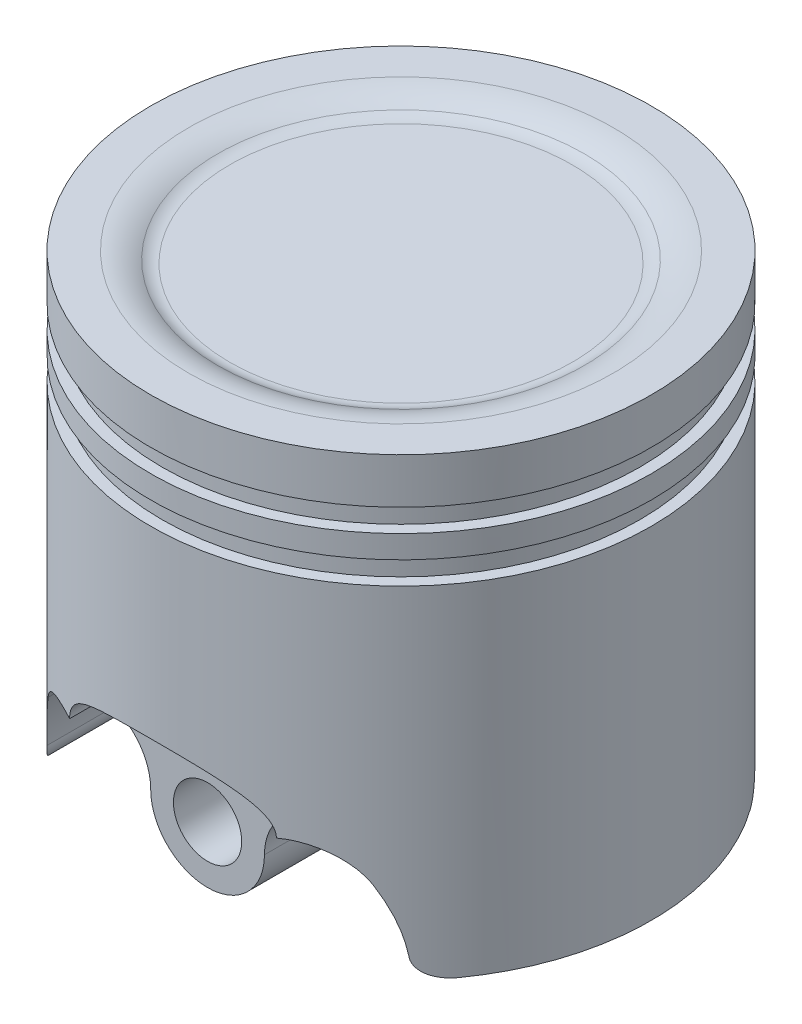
ISO-10303-21;
HEADER;
FILE_DESCRIPTION(('STEP AP214'),'2;1');
FILE_NAME('part.step','',(''),(''),'','','');
FILE_SCHEMA(('AUTOMOTIVE_DESIGN { 1 0 10303 214 1 1 1 1 }'));
ENDSEC;
DATA;
#1=APPLICATION_CONTEXT('core data for automotive mechanical design processes');
#2=APPLICATION_PROTOCOL_DEFINITION('international standard','automotive_design',2000,#1);
#3=PRODUCT_CONTEXT('',#1,'mechanical');
#4=PRODUCT('Part','Part','',(#3));
#5=PRODUCT_RELATED_PRODUCT_CATEGORY('part','',(#4));
#6=PRODUCT_DEFINITION_FORMATION('','',#4);
#7=PRODUCT_DEFINITION_CONTEXT('part definition',#1,'design');
#8=PRODUCT_DEFINITION('design','',#6,#7);
#9=PRODUCT_DEFINITION_SHAPE('','',#8);
#10=(LENGTH_UNIT() NAMED_UNIT(*) SI_UNIT(.MILLI.,.METRE.));
#11=(NAMED_UNIT(*) PLANE_ANGLE_UNIT() SI_UNIT($,.RADIAN.));
#12=(NAMED_UNIT(*) SI_UNIT($,.STERADIAN.) SOLID_ANGLE_UNIT());
#13=UNCERTAINTY_MEASURE_WITH_UNIT(LENGTH_MEASURE(1.E-05),#10,'distance_accuracy_value','');
#14=(GEOMETRIC_REPRESENTATION_CONTEXT(3) GLOBAL_UNCERTAINTY_ASSIGNED_CONTEXT((#13)) GLOBAL_UNIT_ASSIGNED_CONTEXT((#10,
#11,#12)) REPRESENTATION_CONTEXT('',''));
#15=CARTESIAN_POINT('',(0.,0.,0.));
#16=DIRECTION('',(0.,0.,1.));
#17=DIRECTION('',(1.,0.,0.));
#18=AXIS2_PLACEMENT_3D('',#15,#16,#17);
#19=CARTESIAN_POINT('',(0.,50.8,0.));
#20=DIRECTION('',(0.,-1.,0.));
#21=DIRECTION('',(0.,0.,-1.));
#22=AXIS2_PLACEMENT_3D('',#19,#20,#21);
#23=CYLINDRICAL_SURFACE('',#22,27.94);
#24=CARTESIAN_POINT('',(0.,38.1,0.));
#25=DIRECTION('',(0.,-1.,0.));
#26=DIRECTION('',(1.,0.,0.));
#27=AXIS2_PLACEMENT_3D('',#24,#25,#26);
#28=CIRCLE('',#27,27.94);
#29=CARTESIAN_POINT('',(27.94,38.1,0.));
#30=VERTEX_POINT('',#29);
#31=EDGE_CURVE('E751',#30,#30,#28,.T.);
#32=ORIENTED_EDGE('',*,*,#31,.T.);
#33=EDGE_LOOP('',(#32));
#34=FACE_BOUND('',#33,.T.);
#35=CARTESIAN_POINT('',(11.5364474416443,12.4911740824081,25.4470819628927));
#36=CARTESIAN_POINT('',(11.5364473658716,12.4254761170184,25.4470820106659));
#37=CARTESIAN_POINT('',(11.5335449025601,12.3597746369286,25.4483984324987));
#38=CARTESIAN_POINT('',(11.522029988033,12.2289781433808,25.453613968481));
#39=CARTESIAN_POINT('',(11.5134169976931,12.1638831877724,25.4575133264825));
#40=CARTESIAN_POINT('',(11.4907381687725,12.0347866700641,25.4677578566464));
#41=CARTESIAN_POINT('',(11.4766669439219,11.9707862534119,25.4741054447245));
#42=CARTESIAN_POINT('',(11.443463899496,11.8443541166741,25.4890381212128));
#43=CARTESIAN_POINT('',(11.4243291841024,11.7819233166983,25.4976244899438));
#44=CARTESIAN_POINT('',(11.3765086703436,11.644737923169,25.5190024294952));
#45=CARTESIAN_POINT('',(11.3466372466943,11.5704767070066,25.5323073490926));
#46=CARTESIAN_POINT('',(11.2808435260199,11.4251659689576,25.5614448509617));
#47=CARTESIAN_POINT('',(11.2449165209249,11.3541190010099,25.5772793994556));
#48=CARTESIAN_POINT('',(11.1678493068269,11.2153070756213,25.6110232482));
#49=CARTESIAN_POINT('',(11.126701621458,11.1475470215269,25.628935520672));
#50=CARTESIAN_POINT('',(11.0400270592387,11.0154118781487,25.6663911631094));
#51=CARTESIAN_POINT('',(10.9945011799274,10.9510360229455,25.6859341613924));
#52=CARTESIAN_POINT('',(10.8676015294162,10.7829807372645,25.7399742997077));
#53=CARTESIAN_POINT('',(10.7828397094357,10.682226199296,25.7756315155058));
#54=CARTESIAN_POINT('',(10.6052564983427,10.4889793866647,25.8492049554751));
#55=CARTESIAN_POINT('',(10.5124293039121,10.3964931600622,25.8871227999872));
#56=CARTESIAN_POINT('',(10.3203063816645,10.218774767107,25.9643142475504));
#57=CARTESIAN_POINT('',(10.2209993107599,10.1335559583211,26.00359016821));
#58=CARTESIAN_POINT('',(10.0172867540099,9.9697092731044,26.0827437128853));
#59=CARTESIAN_POINT('',(9.91287932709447,9.89108393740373,26.1226215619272));
#60=CARTESIAN_POINT('',(9.69861350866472,9.73881963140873,26.2029338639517));
#61=CARTESIAN_POINT('',(9.58870419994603,9.66525309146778,26.2433691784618));
#62=CARTESIAN_POINT('',(9.36535182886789,9.52356904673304,26.3239035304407));
#63=CARTESIAN_POINT('',(9.25190920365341,9.45545087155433,26.364002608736));
#64=CARTESIAN_POINT('',(8.90686906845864,9.25832957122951,26.483399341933));
#65=CARTESIAN_POINT('',(8.67072006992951,9.13667106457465,26.5617358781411));
#66=CARTESIAN_POINT('',(8.1889682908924,8.90961109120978,26.7141996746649));
#67=CARTESIAN_POINT('',(7.94334858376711,8.80424059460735,26.7883187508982));
#68=CARTESIAN_POINT('',(7.44499681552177,8.60781840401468,26.9310746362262));
#69=CARTESIAN_POINT('',(7.19226654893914,8.51676313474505,26.9997128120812));
#70=CARTESIAN_POINT('',(6.71573227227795,8.35886230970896,27.1218470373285));
#71=CARTESIAN_POINT('',(6.49265820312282,8.29040824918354,27.1761338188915));
#72=CARTESIAN_POINT('',(6.04284074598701,8.1622260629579,27.2796800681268));
#73=CARTESIAN_POINT('',(5.81609691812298,8.10249899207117,27.3289389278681));
#74=CARTESIAN_POINT('',(5.35943004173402,7.99116759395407,27.4221523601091));
#75=CARTESIAN_POINT('',(5.12950552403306,7.93956716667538,27.4661043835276));
#76=CARTESIAN_POINT('',(4.66706787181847,7.84407285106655,27.5484532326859));
#77=CARTESIAN_POINT('',(4.43455446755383,7.80017977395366,27.5868494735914));
#78=CARTESIAN_POINT('',(3.73377642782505,7.67951797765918,27.6934216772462));
#79=CARTESIAN_POINT('',(3.2622345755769,7.61375725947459,27.7529891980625));
#80=CARTESIAN_POINT('',(2.3139208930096,7.50976272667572,27.8480979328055));
#81=CARTESIAN_POINT('',(1.83715023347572,7.47152287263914,27.8836444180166));
#82=CARTESIAN_POINT('',(0.866400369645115,7.42081176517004,27.9309184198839));
#83=CARTESIAN_POINT('',(0.372340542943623,7.40916373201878,27.9418848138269));
#84=CARTESIAN_POINT('',(-0.615611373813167,7.41374917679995,27.9375856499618));
#85=CARTESIAN_POINT('',(-1.10950342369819,7.42998717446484,27.9223158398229));
#86=CARTESIAN_POINT('',(-2.09416973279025,7.49077670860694,27.865773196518));
#87=CARTESIAN_POINT('',(-2.58494321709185,7.53533502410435,27.8244941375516));
#88=CARTESIAN_POINT('',(-3.56000874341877,7.65396662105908,27.7166074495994));
#89=CARTESIAN_POINT('',(-4.04430283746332,7.7280303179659,27.6500080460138));
#90=CARTESIAN_POINT('',(-4.86063490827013,7.88126047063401,27.5160790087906));
#91=CARTESIAN_POINT('',(-5.1952040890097,7.952389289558,27.4548319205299));
#92=CARTESIAN_POINT('',(-5.85804448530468,8.11167954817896,27.3210760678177));
#93=CARTESIAN_POINT('',(-6.18631510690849,8.19984258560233,27.2485662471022));
#94=CARTESIAN_POINT('',(-6.83362579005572,8.39468811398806,27.093457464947));
#95=CARTESIAN_POINT('',(-7.15269459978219,8.50130342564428,27.0108954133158));
#96=CARTESIAN_POINT('',(-7.62332757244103,8.67726340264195,26.8803837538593));
#97=CARTESIAN_POINT('',(-7.77885343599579,8.73857884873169,26.835775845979));
#98=CARTESIAN_POINT('',(-8.08687702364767,8.86703497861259,26.7445656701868));
#99=CARTESIAN_POINT('',(-8.2393751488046,8.93417488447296,26.6979636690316));
#100=CARTESIAN_POINT('',(-8.52396497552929,9.06696417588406,26.6083693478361));
#101=CARTESIAN_POINT('',(-8.65642863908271,9.13193768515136,26.5655576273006));
#102=CARTESIAN_POINT('',(-8.91812249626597,9.26740531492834,26.4788535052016));
#103=CARTESIAN_POINT('',(-9.04735322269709,9.33789851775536,26.4349612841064));
#104=CARTESIAN_POINT('',(-9.30252963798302,9.48529999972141,26.346249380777));
#105=CARTESIAN_POINT('',(-9.42846044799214,9.56223236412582,26.3014267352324));
#106=CARTESIAN_POINT('',(-9.67572703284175,9.72300812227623,26.2114709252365));
#107=CARTESIAN_POINT('',(-9.7970631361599,9.80685102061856,26.1663377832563));
#108=CARTESIAN_POINT('',(-10.0359477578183,9.98373354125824,26.0756576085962));
#109=CARTESIAN_POINT('',(-10.1534074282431,10.0768964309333,26.0301151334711));
#110=CARTESIAN_POINT('',(-10.3810199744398,10.2725068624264,25.9401811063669));
#111=CARTESIAN_POINT('',(-10.4911680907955,10.3749603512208,25.8957903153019));
#112=CARTESIAN_POINT('',(-10.7011255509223,10.5897466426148,25.8097325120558));
#113=CARTESIAN_POINT('',(-10.8009961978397,10.7020124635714,25.7680499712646));
#114=CARTESIAN_POINT('',(-10.9877381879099,10.9380867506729,25.6889753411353));
#115=CARTESIAN_POINT('',(-11.0746342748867,11.061872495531,25.6515751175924));
#116=CARTESIAN_POINT('',(-11.2183278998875,11.3010859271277,25.5890183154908));
#117=CARTESIAN_POINT('',(-11.2777186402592,11.4146540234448,25.5628599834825));
#118=CARTESIAN_POINT('',(-11.354780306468,11.591197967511,25.5286771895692));
#119=CARTESIAN_POINT('',(-11.3784659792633,11.6510869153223,25.5181242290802));
#120=CARTESIAN_POINT('',(-11.4213503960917,11.772740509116,25.4989589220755));
#121=CARTESIAN_POINT('',(-11.4405511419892,11.8345043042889,25.4903457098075));
#122=CARTESIAN_POINT('',(-11.474191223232,11.960298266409,25.4752209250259));
#123=CARTESIAN_POINT('',(-11.4885771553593,12.0243456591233,25.4687329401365));
#124=CARTESIAN_POINT('',(-11.5118941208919,12.1536310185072,25.4582021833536));
#125=CARTESIAN_POINT('',(-11.5208253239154,12.2188689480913,25.4541593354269));
#126=CARTESIAN_POINT('',(-11.5329497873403,12.3499473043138,25.4486682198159));
#127=CARTESIAN_POINT('',(-11.5361466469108,12.4157873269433,25.4472183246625));
#128=CARTESIAN_POINT('',(-11.536707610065,12.5474947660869,25.4469640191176));
#129=CARTESIAN_POINT('',(-11.5340721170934,12.6133621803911,25.4481594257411));
#130=CARTESIAN_POINT('',(-11.5236435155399,12.7375295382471,25.4528832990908));
#131=CARTESIAN_POINT('',(-11.5164288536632,12.795889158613,25.4561500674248));
#132=CARTESIAN_POINT('',(-11.4975990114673,12.9117570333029,25.4646602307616));
#133=CARTESIAN_POINT('',(-11.4859823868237,12.9692650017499,25.4699042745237));
#134=CARTESIAN_POINT('',(-11.4449122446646,13.1399917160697,25.4883994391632));
#135=CARTESIAN_POINT('',(-11.4092354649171,13.2514461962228,25.5044149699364));
#136=CARTESIAN_POINT('',(-11.305434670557,13.5149290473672,25.5506388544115));
#137=CARTESIAN_POINT('',(-11.2299459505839,13.663472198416,25.5839907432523));
#138=CARTESIAN_POINT('',(-11.1013478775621,13.8751016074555,25.6399277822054));
#139=CARTESIAN_POINT('',(-11.0558318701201,13.9438862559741,25.6595962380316));
#140=CARTESIAN_POINT('',(-10.960429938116,14.0778753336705,25.7004915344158));
#141=CARTESIAN_POINT('',(-10.9105446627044,14.1430802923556,25.7217181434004));
#142=CARTESIAN_POINT('',(-10.7688575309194,14.3170042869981,25.7814819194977));
#143=CARTESIAN_POINT('',(-10.67332397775,14.422268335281,25.8212187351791));
#144=CARTESIAN_POINT('',(-10.4738115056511,14.6235974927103,25.9027898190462));
#145=CARTESIAN_POINT('',(-10.369826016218,14.7196553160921,25.9446257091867));
#146=CARTESIAN_POINT('',(-10.1551230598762,14.9037746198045,26.0294145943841));
#147=CARTESIAN_POINT('',(-10.0443938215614,14.9918214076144,26.0723694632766));
#148=CARTESIAN_POINT('',(-9.81765885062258,15.1607175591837,26.1585913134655));
#149=CARTESIAN_POINT('',(-9.7016511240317,15.2415641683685,26.2018584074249));
#150=CARTESIAN_POINT('',(-9.46317291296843,15.398264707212,26.2889400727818));
#151=CARTESIAN_POINT('',(-9.34062278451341,15.4739993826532,26.3327500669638));
#152=CARTESIAN_POINT('',(-9.09183184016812,15.6195031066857,26.4196813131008));
#153=CARTESIAN_POINT('',(-8.96559147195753,15.6892728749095,26.4628026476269));
#154=CARTESIAN_POINT('',(-8.7098517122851,15.8234928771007,26.5480746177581));
#155=CARTESIAN_POINT('',(-8.58034961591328,15.887938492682,26.5902243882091));
#156=CARTESIAN_POINT('',(-8.31861316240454,16.0119183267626,26.6732664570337));
#157=CARTESIAN_POINT('',(-8.18637848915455,16.0714519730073,26.7141586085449));
#158=CARTESIAN_POINT('',(-7.78571635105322,16.2434535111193,26.8347537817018));
#159=CARTESIAN_POINT('',(-7.51368934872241,16.3491372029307,26.912255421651));
#160=CARTESIAN_POINT('',(-6.96229873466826,16.5447548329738,27.060146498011));
#161=CARTESIAN_POINT('',(-6.68293691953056,16.6346925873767,27.1305376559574));
#162=CARTESIAN_POINT('',(-6.16883872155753,16.7856541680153,27.2515270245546));
#163=CARTESIAN_POINT('',(-5.93507331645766,16.8489714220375,27.3034119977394));
#164=CARTESIAN_POINT('',(-5.46415741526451,16.9668042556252,27.4015415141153));
#165=CARTESIAN_POINT('',(-5.22700656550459,17.021318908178,27.4477854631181));
#166=CARTESIAN_POINT('',(-4.51112566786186,17.1725040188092,27.5776794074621));
#167=CARTESIAN_POINT('',(-4.02809032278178,17.2567802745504,27.6524623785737));
#168=CARTESIAN_POINT('',(-3.05434183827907,17.3950710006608,27.7768940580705));
#169=CARTESIAN_POINT('',(-2.56362450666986,17.4490683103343,27.8265285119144));
#170=CARTESIAN_POINT('',(-1.57804605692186,17.5282539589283,27.8997755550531));
#171=CARTESIAN_POINT('',(-1.08318581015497,17.553448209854,27.9233934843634));
#172=CARTESIAN_POINT('',(-0.081420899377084,17.5759503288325,27.9444703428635));
#173=CARTESIAN_POINT('',(0.425510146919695,17.5726352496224,27.9413449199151));
#174=CARTESIAN_POINT('',(1.43749428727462,17.5365389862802,27.9075907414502));
#175=CARTESIAN_POINT('',(1.94254698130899,17.5037518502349,27.8769564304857));
#176=CARTESIAN_POINT('',(2.94675537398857,17.407861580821,27.7887342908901));
#177=CARTESIAN_POINT('',(3.44591849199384,17.3448019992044,27.7311851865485));
#178=CARTESIAN_POINT('',(4.18782058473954,17.2260616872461,27.6255002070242));
#179=CARTESIAN_POINT('',(4.43395633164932,17.182462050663,27.5870498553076));
#180=CARTESIAN_POINT('',(4.92350760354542,17.0868172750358,27.5038955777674));
#181=CARTESIAN_POINT('',(5.1669234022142,17.0347729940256,27.4591922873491));
#182=CARTESIAN_POINT('',(5.67966347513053,16.9149322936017,27.3580206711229));
#183=CARTESIAN_POINT('',(5.94857058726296,16.8459929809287,27.3007836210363));
#184=CARTESIAN_POINT('',(6.48135989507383,16.6959731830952,27.1792239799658));
#185=CARTESIAN_POINT('',(6.74524222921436,16.6148930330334,27.114901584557));
#186=CARTESIAN_POINT('',(7.26676294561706,16.4393518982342,26.9798126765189));
#187=CARTESIAN_POINT('',(7.52440317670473,16.3448949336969,26.9090481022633));
#188=CARTESIAN_POINT('',(8.03196968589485,16.1408571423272,26.7619278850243));
#189=CARTESIAN_POINT('',(8.28189827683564,16.0312809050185,26.6855739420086));
#190=CARTESIAN_POINT('',(8.68406470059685,15.8369436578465,26.5566925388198));
#191=CARTESIAN_POINT('',(8.83921705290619,15.757360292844,26.5054312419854));
#192=CARTESIAN_POINT('',(9.14461349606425,15.5900514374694,26.4016215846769));
#193=CARTESIAN_POINT('',(9.29485863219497,15.502327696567,26.349073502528));
#194=CARTESIAN_POINT('',(9.58912945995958,15.3177447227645,26.243410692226));
#195=CARTESIAN_POINT('',(9.73316360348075,15.2208985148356,26.1902968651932));
#196=CARTESIAN_POINT('',(10.0135874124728,15.0165821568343,26.0843645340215));
#197=CARTESIAN_POINT('',(10.1499814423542,14.9091181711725,26.0315458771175));
#198=CARTESIAN_POINT('',(10.3523582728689,14.734020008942,25.9514573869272));
#199=CARTESIAN_POINT('',(10.4219061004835,14.6707639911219,25.9235961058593));
#200=CARTESIAN_POINT('',(10.557517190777,14.5403101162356,25.8686639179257));
#201=CARTESIAN_POINT('',(10.6235813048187,14.4731132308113,25.8415928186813));
#202=CARTESIAN_POINT('',(10.7515561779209,14.3344486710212,25.7886105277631));
#203=CARTESIAN_POINT('',(10.8134680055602,14.262982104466,25.7626990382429));
#204=CARTESIAN_POINT('',(10.9322710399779,14.1154771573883,25.712510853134));
#205=CARTESIAN_POINT('',(10.9891635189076,14.0394399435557,25.6882337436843));
#206=CARTESIAN_POINT('',(11.12521426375,13.8412376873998,25.6296930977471));
#207=CARTESIAN_POINT('',(11.2003799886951,13.7158142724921,25.5968785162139));
#208=CARTESIAN_POINT('',(11.3315613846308,13.453676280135,25.5390776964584));
#209=CARTESIAN_POINT('',(11.3876153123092,13.3169849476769,25.5140758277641));
#210=CARTESIAN_POINT('',(11.4652558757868,13.0654885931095,25.479264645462));
#211=CARTESIAN_POINT('',(11.4917221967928,12.9525234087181,25.4673188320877));
#212=CARTESIAN_POINT('',(11.5184338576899,12.7807320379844,25.4552423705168));
#213=CARTESIAN_POINT('',(11.5251731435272,12.7230689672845,25.4521905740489));
#214=CARTESIAN_POINT('',(11.5341793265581,12.6073294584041,25.44811063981));
#215=CARTESIAN_POINT('',(11.5364475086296,12.5492531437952,25.4470819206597));
#216=CARTESIAN_POINT('',(11.5364474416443,12.4911740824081,25.4470819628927));
#217=B_SPLINE_CURVE_WITH_KNOTS('',3,(#35,#36,#37,#38,#39,#40,#41,#42,#43,#44,#45,#46,#47,#48,
#49,#50,#51,#52,#53,#54,#55,#56,#57,#58,#59,#60,#61,#62,#63,#64,#65,#66,#67,#68,#69,#70,#71,#72,
#73,#74,#75,#76,#77,#78,#79,#80,#81,#82,#83,#84,#85,#86,#87,#88,#89,#90,#91,#92,#93,#94,#95,#96,
#97,#98,#99,#100,#101,#102,#103,#104,#105,#106,#107,#108,#109,#110,#111,#112,#113,#114,#115,
#116,#117,#118,#119,#120,#121,#122,#123,#124,#125,#126,#127,#128,#129,#130,#131,#132,#133,#134,
#135,#136,#137,#138,#139,#140,#141,#142,#143,#144,#145,#146,#147,#148,#149,#150,#151,#152,#153,
#154,#155,#156,#157,#158,#159,#160,#161,#162,#163,#164,#165,#166,#167,#168,#169,#170,#171,#172,
#173,#174,#175,#176,#177,#178,#179,#180,#181,#182,#183,#184,#185,#186,#187,#188,#189,#190,#191,
#192,#193,#194,#195,#196,#197,#198,#199,#200,#201,#202,#203,#204,#205,#206,#207,#208,#209,#210,
#211,#212,#213,#214,#215,#216),.UNSPECIFIED.,.T.,.F.,(4,2,2,2,2,2,2,2,2,2,2,2,2,2,2,2,2,2,2,2,2,
2,2,2,2,2,2,2,2,2,2,2,2,2,2,2,2,2,2,2,2,2,2,2,2,2,2,2,2,2,2,2,2,2,2,2,2,2,2,2,2,2,2,2,2,2,2,2,2,
2,2,2,2,2,2,2,2,2,2,2,2,2,2,2,2,2,2,2,2,2,4),(0.,0.19702412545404,0.39406685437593,
0.591304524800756,0.788655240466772,1.03169893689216,1.27493247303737,1.51851835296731,
1.76204886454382,2.17059235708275,2.57943228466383,2.98900815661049,3.39874113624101,
3.81346657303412,4.22814090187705,5.0581017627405,5.88962180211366,6.72093383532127,
7.43940885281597,8.15797063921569,8.87687621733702,9.5958574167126,11.0336962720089,
12.4712194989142,13.952674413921,15.4343694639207,16.9164193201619,18.3979881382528,
19.4398620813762,20.4818337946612,21.5200888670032,22.0390560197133,22.5579539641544,
23.0187119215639,23.4793934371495,23.941882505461,24.4043384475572,24.8740229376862,
25.3440102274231,25.8110081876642,26.2771038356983,26.668208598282,26.863816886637,
27.0593376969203,27.2569603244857,27.4545768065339,27.6520692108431,27.8495479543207,
28.0260204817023,28.2025509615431,28.555513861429,29.0622961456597,29.3165400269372,
29.570746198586,30.0128207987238,30.4552424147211,30.8984597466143,31.3418459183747,
31.7933913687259,32.2448822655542,32.6967607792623,33.1486918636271,34.0538137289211,
34.9587159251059,35.7015116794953,36.444385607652,37.9305260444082,39.4175079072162,
40.9041845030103,42.4234271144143,43.942976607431,45.4603465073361,46.2188782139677,
46.9773328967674,47.827289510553,48.6772226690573,49.5269009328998,50.3763218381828,
50.9213688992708,51.4662990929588,52.0104627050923,52.5543122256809,52.8483553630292,
53.1423263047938,53.4362213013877,53.7300415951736,54.178126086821,54.6253082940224,
54.9736566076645,55.1478821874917,55.3220576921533),.UNSPECIFIED.);
#218=CARTESIAN_POINT('',(-11.5364474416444,12.4911740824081,25.4470819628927));
#219=VERTEX_POINT('',#218);
#220=CARTESIAN_POINT('',(11.5364474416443,12.4911740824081,25.4470819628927));
#221=VERTEX_POINT('',#220);
#222=EDGE_CURVE('E478',#219,#221,#217,.T.);
#223=ORIENTED_EDGE('',*,*,#222,.T.);
#224=CARTESIAN_POINT('',(6.35,6.35,27.2088423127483));
#225=CARTESIAN_POINT('',(6.34997917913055,6.52079894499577,27.2088350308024));
#226=CARTESIAN_POINT('',(6.35702401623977,6.69159519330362,27.2072026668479));
#227=CARTESIAN_POINT('',(6.38509494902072,7.03196240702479,27.2006350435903));
#228=CARTESIAN_POINT('',(6.40612031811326,7.2015334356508,27.1956999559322));
#229=CARTESIAN_POINT('',(6.46197771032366,7.53810024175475,27.1824799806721));
#230=CARTESIAN_POINT('',(6.4967975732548,7.70509815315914,27.174198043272));
#231=CARTESIAN_POINT('',(6.57994805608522,8.03548215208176,27.1541842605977));
#232=CARTESIAN_POINT('',(6.62827850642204,8.19886828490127,27.1424524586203));
#233=CARTESIAN_POINT('',(6.73806355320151,8.52091951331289,27.1154068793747));
#234=CARTESIAN_POINT('',(6.7995220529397,8.67958318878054,27.1000920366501));
#235=CARTESIAN_POINT('',(6.93505848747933,8.99107561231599,27.0657246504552));
#236=CARTESIAN_POINT('',(7.00914105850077,9.14390219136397,27.0466707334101));
#237=CARTESIAN_POINT('',(7.16923996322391,9.44252394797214,27.0046744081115));
#238=CARTESIAN_POINT('',(7.25525104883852,9.58832217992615,26.9817337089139));
#239=CARTESIAN_POINT('',(7.43848995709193,9.87196091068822,26.9317931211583));
#240=CARTESIAN_POINT('',(7.53571804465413,10.0098012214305,26.9047931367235));
#241=CARTESIAN_POINT('',(7.74078188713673,10.2769115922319,26.8465133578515));
#242=CARTESIAN_POINT('',(7.84864183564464,10.4061609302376,26.8152237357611));
#243=CARTESIAN_POINT('',(8.07383584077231,10.6549098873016,26.7482816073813));
#244=CARTESIAN_POINT('',(8.19117009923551,10.7744092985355,26.7126290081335));
#245=CARTESIAN_POINT('',(8.4342810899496,11.0029318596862,26.6368674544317));
#246=CARTESIAN_POINT('',(8.56005740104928,11.1119555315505,26.5967587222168));
#247=CARTESIAN_POINT('',(8.81901875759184,11.3189744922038,26.5120175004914));
#248=CARTESIAN_POINT('',(8.95220638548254,11.4169659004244,26.4673834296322));
#249=CARTESIAN_POINT('',(9.22732786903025,11.6031035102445,26.3727428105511));
#250=CARTESIAN_POINT('',(9.36937726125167,11.6910364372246,26.3226528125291));
#251=CARTESIAN_POINT('',(9.65880424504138,11.8546214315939,26.2178335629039));
#252=CARTESIAN_POINT('',(9.80618375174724,11.9302690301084,26.1631026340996));
#253=CARTESIAN_POINT('',(10.1049945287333,12.0690229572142,26.0491505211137));
#254=CARTESIAN_POINT('',(10.2564247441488,12.1321325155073,25.9899304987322));
#255=CARTESIAN_POINT('',(10.5622718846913,12.2457849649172,25.8671449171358));
#256=CARTESIAN_POINT('',(10.7166899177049,12.2963230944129,25.8035777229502));
#257=CARTESIAN_POINT('',(11.0358864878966,12.3872763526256,25.668743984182));
#258=CARTESIAN_POINT('',(11.2007691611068,12.4269852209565,25.5972464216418));
#259=CARTESIAN_POINT('',(11.5314044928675,12.4926318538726,25.4500128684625));
#260=CARTESIAN_POINT('',(11.6971574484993,12.5185645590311,25.3742753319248));
#261=CARTESIAN_POINT('',(12.1939649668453,12.576052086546,25.1412822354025));
#262=CARTESIAN_POINT('',(12.5248028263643,12.5873616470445,24.9781474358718));
#263=CARTESIAN_POINT('',(13.2101507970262,12.5574148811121,24.6231422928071));
#264=CARTESIAN_POINT('',(13.5637547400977,12.5108342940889,24.4300266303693));
#265=CARTESIAN_POINT('',(14.2534450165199,12.3601681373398,24.0341642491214));
#266=CARTESIAN_POINT('',(14.5895103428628,12.2560152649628,23.8314065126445));
#267=CARTESIAN_POINT('',(15.0939118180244,12.0521448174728,23.5130452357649));
#268=CARTESIAN_POINT('',(15.2706711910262,11.9708538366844,23.3985723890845));
#269=CARTESIAN_POINT('',(15.615908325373,11.7920845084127,23.1695884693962));
#270=CARTESIAN_POINT('',(15.7843843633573,11.694602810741,23.0550773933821));
#271=CARTESIAN_POINT('',(16.1118069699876,11.4840515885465,22.827461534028));
#272=CARTESIAN_POINT('',(16.2707675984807,11.3710059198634,22.7143548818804));
#273=CARTESIAN_POINT('',(16.5784860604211,11.1295154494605,22.4907436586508));
#274=CARTESIAN_POINT('',(16.7272453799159,11.0010728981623,22.3802387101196));
#275=CARTESIAN_POINT('',(16.9957240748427,10.7458971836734,22.1768732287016));
#276=CARTESIAN_POINT('',(17.1167558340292,10.620931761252,22.0835254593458));
#277=CARTESIAN_POINT('',(17.3493082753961,10.3595182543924,21.9012994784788));
#278=CARTESIAN_POINT('',(17.4608330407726,10.223075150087,21.8124193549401));
#279=CARTESIAN_POINT('',(17.6738177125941,9.93832400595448,21.64020676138));
#280=CARTESIAN_POINT('',(17.7752425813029,9.78997768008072,21.5568939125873));
#281=CARTESIAN_POINT('',(17.9665242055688,9.48193478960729,21.397739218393));
#282=CARTESIAN_POINT('',(18.0563656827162,9.32222365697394,21.3219072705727));
#283=CARTESIAN_POINT('',(18.1397424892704,9.15708154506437,21.2507256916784));
#284=B_SPLINE_CURVE_WITH_KNOTS('',3,(#224,#225,#226,#227,#228,#229,#230,#231,#232,#233,#234,
#235,#236,#237,#238,#239,#240,#241,#242,#243,#244,#245,#246,#247,#248,#249,#250,#251,#252,#253,
#254,#255,#256,#257,#258,#259,#260,#261,#262,#263,#264,#265,#266,#267,#268,#269,#270,#271,#272,
#273,#274,#275,#276,#277,#278,#279,#280,#281,#282,#283),.UNSPECIFIED.,.F.,.F.,(4,2,2,2,2,2,2,2,
2,2,2,2,2,2,2,2,2,2,2,2,2,2,2,2,2,2,2,2,2,4),(0.,0.512240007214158,1.0244533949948,
1.53621625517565,2.04797269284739,2.55988150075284,3.0719787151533,3.58385133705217,
4.09573605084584,4.60881373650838,5.12190235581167,5.63496539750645,6.14820834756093,
6.67085476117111,7.19369086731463,7.71639211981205,8.23929105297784,8.79083656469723,
9.34258449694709,10.445300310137,11.6573739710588,12.870867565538,13.5474534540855,
14.224179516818,14.8998796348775,15.5754811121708,16.1672011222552,16.7586656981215,
17.352115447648,17.9463401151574),.UNSPECIFIED.);
#285=CARTESIAN_POINT('',(18.1397424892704,9.15708154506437,21.2507256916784));
#286=VERTEX_POINT('',#285);
#287=EDGE_CURVE('E360',#221,#286,#284,.T.);
#288=ORIENTED_EDGE('',*,*,#287,.T.);
#289=CARTESIAN_POINT('',(18.1397424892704,9.15708154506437,21.2507256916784));
#290=CARTESIAN_POINT('',(18.3508922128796,8.73876591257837,21.070522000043));
#291=CARTESIAN_POINT('',(18.5487410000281,8.31090153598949,20.8961583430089));
#292=CARTESIAN_POINT('',(18.9165534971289,7.43588577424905,20.5637754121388));
#293=CARTESIAN_POINT('',(19.0864483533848,6.98869009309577,20.4057968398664));
#294=CARTESIAN_POINT('',(19.3931252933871,6.08541012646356,20.1145292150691));
#295=CARTESIAN_POINT('',(19.5304685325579,5.62964973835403,19.9808327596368));
#296=CARTESIAN_POINT('',(19.7739246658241,4.70351416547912,19.739931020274));
#297=CARTESIAN_POINT('',(19.8800792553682,4.23315943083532,19.6326903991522));
#298=CARTESIAN_POINT('',(20.0074038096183,3.55638149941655,19.5025709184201));
#299=CARTESIAN_POINT('',(20.0421845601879,3.35488287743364,19.4668063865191));
#300=CARTESIAN_POINT('',(20.1058922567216,2.94920535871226,19.4009994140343));
#301=CARTESIAN_POINT('',(20.1347957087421,2.74501904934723,19.3709799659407));
#302=CARTESIAN_POINT('',(20.1606249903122,2.54000000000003,19.3440636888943));
#303=B_SPLINE_CURVE_WITH_KNOTS('',3,(#289,#290,#291,#292,#293,#294,#295,#296,#297,#298,#299,
#300,#301,#302),.UNSPECIFIED.,.F.,.F.,(4,2,2,2,2,2,4),(0.,1.50623535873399,3.016126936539,
4.49770694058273,5.97729714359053,6.59989512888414,7.22493497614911),.UNSPECIFIED.);
#304=CARTESIAN_POINT('',(20.1606249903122,2.54000000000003,19.3440636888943));
#305=VERTEX_POINT('',#304);
#306=EDGE_CURVE('E620',#286,#305,#303,.T.);
#307=ORIENTED_EDGE('',*,*,#306,.T.);
#308=CARTESIAN_POINT('',(0.,2.54000000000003,0.));
#309=DIRECTION('',(0.,-1.,0.));
#310=DIRECTION('',(0.,0.,-1.));
#311=AXIS2_PLACEMENT_3D('',#308,#309,#310);
#312=CIRCLE('',#311,27.94);
#313=CARTESIAN_POINT('',(20.1784506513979,2.54000000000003,19.3254684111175));
#314=VERTEX_POINT('',#313);
#315=EDGE_CURVE('E792',#314,#305,#312,.T.);
#316=ORIENTED_EDGE('',*,*,#315,.F.);
#317=CARTESIAN_POINT('',(20.1784506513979,2.54000000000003,19.3254684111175));
#318=CARTESIAN_POINT('',(20.1784367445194,2.48441301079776,19.3254807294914));
#319=CARTESIAN_POINT('',(20.1802749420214,2.42883596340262,19.3235635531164));
#320=CARTESIAN_POINT('',(20.1875489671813,2.31821598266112,19.3159653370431));
#321=CARTESIAN_POINT('',(20.1929821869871,2.2631726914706,19.3102870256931));
#322=CARTESIAN_POINT('',(20.2072813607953,2.15449788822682,19.2953227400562));
#323=CARTESIAN_POINT('',(20.2161189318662,2.10085851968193,19.2860665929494));
#324=CARTESIAN_POINT('',(20.2370336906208,1.99494175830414,19.2641194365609));
#325=CARTESIAN_POINT('',(20.2491112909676,1.94266453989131,19.2514279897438));
#326=CARTESIAN_POINT('',(20.2897972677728,1.78869606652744,19.2085730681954));
#327=CARTESIAN_POINT('',(20.3229128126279,1.6894757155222,19.1735729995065));
#328=CARTESIAN_POINT('',(20.3990225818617,1.49962589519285,19.092578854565));
#329=CARTESIAN_POINT('',(20.4420379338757,1.40901539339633,19.0465612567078));
#330=CARTESIAN_POINT('',(20.5542136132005,1.20349552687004,18.9255660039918));
#331=CARTESIAN_POINT('',(20.6269984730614,1.09307268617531,18.846320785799));
#332=CARTESIAN_POINT('',(20.7823468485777,0.890931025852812,18.6748801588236));
#333=CARTESIAN_POINT('',(20.8649248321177,0.799240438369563,18.5826655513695));
#334=CARTESIAN_POINT('',(21.0749349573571,0.595649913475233,18.3446389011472));
#335=CARTESIAN_POINT('',(21.2057246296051,0.493443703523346,18.1934861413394));
#336=CARTESIAN_POINT('',(21.4056430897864,0.364116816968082,17.956975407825));
#337=CARTESIAN_POINT('',(21.4730805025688,0.324936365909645,17.8762913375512));
#338=CARTESIAN_POINT('',(21.6086022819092,0.254025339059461,17.7122322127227));
#339=CARTESIAN_POINT('',(21.6766864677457,0.222292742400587,17.6288578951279));
#340=CARTESIAN_POINT('',(21.8276524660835,0.159637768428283,17.4417486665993));
#341=CARTESIAN_POINT('',(21.9105654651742,0.130359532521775,17.3374935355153));
#342=CARTESIAN_POINT('',(22.0759485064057,0.081090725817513,17.1264149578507));
#343=CARTESIAN_POINT('',(22.1584183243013,0.0611044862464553,17.0195903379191));
#344=CARTESIAN_POINT('',(22.3213057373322,0.029886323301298,16.8053790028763));
#345=CARTESIAN_POINT('',(22.4017360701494,0.0185436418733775,16.6980177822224));
#346=CARTESIAN_POINT('',(22.5611992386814,0.00361528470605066,16.4819286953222));
#347=CARTESIAN_POINT('',(22.6402336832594,2.00100648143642E-05,16.3732026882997));
#348=CARTESIAN_POINT('',(22.7184506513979,0.,16.2639355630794));
#349=B_SPLINE_CURVE_WITH_KNOTS('',3,(#317,#318,#319,#320,#321,#322,#323,#324,#325,#326,#327,
#328,#329,#330,#331,#332,#333,#334,#335,#336,#337,#338,#339,#340,#341,#342,#343,#344,#345,#346,
#347,#348),.UNSPECIFIED.,.F.,.F.,(4,2,2,2,2,2,2,2,2,2,2,2,2,2,2,4),(0.,0.166681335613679,
0.333241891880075,0.498442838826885,0.663664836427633,0.992925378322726,1.3228952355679,
1.78283302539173,2.24345897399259,2.91298885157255,3.24946278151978,3.58584530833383,
3.99462229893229,4.40358963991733,4.8072240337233,5.21035804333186),.UNSPECIFIED.);
#350=CARTESIAN_POINT('',(22.7184506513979,0.,16.2639355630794));
#351=VERTEX_POINT('',#350);
#352=EDGE_CURVE('E611',#314,#351,#349,.T.);
#353=ORIENTED_EDGE('',*,*,#352,.T.);
#354=CARTESIAN_POINT('',(0.,0.,0.));
#355=DIRECTION('',(0.,1.,0.));
#356=DIRECTION('',(0.,0.,1.));
#357=AXIS2_PLACEMENT_3D('',#354,#355,#356);
#358=CIRCLE('',#357,27.94);
#359=CARTESIAN_POINT('',(22.7184506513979,0.,-16.2639355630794));
#360=VERTEX_POINT('',#359);
#361=EDGE_CURVE('E770',#351,#360,#358,.T.);
#362=ORIENTED_EDGE('',*,*,#361,.T.);
#363=CARTESIAN_POINT('',(22.7184506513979,0.,-16.2639355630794));
#364=CARTESIAN_POINT('',(22.6659558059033,3.78461321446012E-06,-16.3372641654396));
#365=CARTESIAN_POINT('',(22.6131091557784,0.00162729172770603,-16.4103325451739));
#366=CARTESIAN_POINT('',(22.5067733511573,0.00827418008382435,-16.5558714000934));
#367=CARTESIAN_POINT('',(22.453284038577,0.013298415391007,-16.628341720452));
#368=CARTESIAN_POINT('',(22.2915308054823,0.0337691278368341,-16.8452916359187));
#369=CARTESIAN_POINT('',(22.1824250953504,0.0546164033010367,-16.9886907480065));
#370=CARTESIAN_POINT('',(21.96141150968,0.112707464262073,-17.2734763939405));
#371=CARTESIAN_POINT('',(21.8494861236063,0.150191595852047,-17.414800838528));
#372=CARTESIAN_POINT('',(21.6261745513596,0.24366550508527,-17.6913429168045));
#373=CARTESIAN_POINT('',(21.5147877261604,0.299616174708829,-17.8265727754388));
#374=CARTESIAN_POINT('',(21.3535976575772,0.3970228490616,-18.0187085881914));
#375=CARTESIAN_POINT('',(21.3026684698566,0.430266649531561,-18.0788812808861));
#376=CARTESIAN_POINT('',(21.2017641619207,0.501597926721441,-18.1971108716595));
#377=CARTESIAN_POINT('',(21.1517890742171,0.539685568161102,-18.2551676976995));
#378=CARTESIAN_POINT('',(21.0042081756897,0.661385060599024,-18.4252322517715));
#379=CARTESIAN_POINT('',(20.9085165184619,0.752684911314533,-18.533645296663));
#380=CARTESIAN_POINT('',(20.7418625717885,0.940699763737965,-18.7198216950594));
#381=CARTESIAN_POINT('',(20.6694294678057,1.03401333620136,-18.799687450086));
#382=CARTESIAN_POINT('',(20.5348013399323,1.23691198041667,-18.94664698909));
#383=CARTESIAN_POINT('',(20.4725973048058,1.34648256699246,-19.0137520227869));
#384=CARTESIAN_POINT('',(20.3750853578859,1.55491845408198,-19.1181443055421));
#385=CARTESIAN_POINT('',(20.3368722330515,1.65075698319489,-19.1587438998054));
#386=CARTESIAN_POINT('',(20.2716636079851,1.85022839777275,-19.227727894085));
#387=CARTESIAN_POINT('',(20.2446444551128,1.95384429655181,-19.2561380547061));
#388=CARTESIAN_POINT('',(20.2092038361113,2.13802189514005,-19.2933187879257));
#389=CARTESIAN_POINT('',(20.1977435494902,2.21735698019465,-19.305307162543));
#390=CARTESIAN_POINT('',(20.1862063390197,2.33758880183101,-19.3173678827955));
#391=CARTESIAN_POINT('',(20.183302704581,2.37794376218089,-19.3204012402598));
#392=CARTESIAN_POINT('',(20.1794231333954,2.45886217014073,-19.3244530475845));
#393=CARTESIAN_POINT('',(20.1784479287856,2.4994256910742,-19.3254707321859));
#394=CARTESIAN_POINT('',(20.1784506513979,2.54000000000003,-19.3254684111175));
#395=B_SPLINE_CURVE_WITH_KNOTS('',3,(#363,#364,#365,#366,#367,#368,#369,#370,#371,#372,#373,
#374,#375,#376,#377,#378,#379,#380,#381,#382,#383,#384,#385,#386,#387,#388,#389,#390,#391,#392,
#393,#394),.UNSPECIFIED.,.F.,.F.,(4,2,2,2,2,2,2,2,2,2,2,2,2,2,2,4),(0.,0.270513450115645,
0.541094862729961,1.08453677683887,1.63609893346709,2.18650041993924,2.44301565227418,
2.69953961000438,3.21046135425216,3.63676110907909,4.06268328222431,4.39401405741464,
4.72464112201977,4.96703777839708,5.08866921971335,5.21034683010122),.UNSPECIFIED.);
#396=CARTESIAN_POINT('',(20.1784506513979,2.54000000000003,-19.3254684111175));
#397=VERTEX_POINT('',#396);
#398=EDGE_CURVE('E649',#360,#397,#395,.T.);
#399=ORIENTED_EDGE('',*,*,#398,.T.);
#400=CARTESIAN_POINT('',(20.1606249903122,2.54000000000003,-19.3440636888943));
#401=VERTEX_POINT('',#400);
#402=EDGE_CURVE('E796',#401,#397,#312,.T.);
#403=ORIENTED_EDGE('',*,*,#402,.F.);
#404=CARTESIAN_POINT('',(20.1606249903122,2.54000000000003,-19.3440636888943));
#405=CARTESIAN_POINT('',(20.1294644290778,2.7873552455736,-19.3765318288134));
#406=CARTESIAN_POINT('',(20.0938254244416,3.03349335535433,-19.4135265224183));
#407=CARTESIAN_POINT('',(20.0138284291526,3.52285489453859,-19.495990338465));
#408=CARTESIAN_POINT('',(19.9694726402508,3.76607904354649,-19.5414573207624));
#409=CARTESIAN_POINT('',(19.823805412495,4.49012250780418,-19.6895791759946));
#410=CARTESIAN_POINT('',(19.7097993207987,4.96605660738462,-19.8040557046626));
#411=CARTESIAN_POINT('',(19.4520888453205,5.89470587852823,-20.0572152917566));
#412=CARTESIAN_POINT('',(19.3088586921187,6.34766308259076,-20.1955069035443));
#413=CARTESIAN_POINT('',(18.9936042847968,7.23655312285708,-20.4922766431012));
#414=CARTESIAN_POINT('',(18.8215831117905,7.67248777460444,-20.6507526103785));
#415=CARTESIAN_POINT('',(18.5581697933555,8.27858154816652,-20.8865716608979));
#416=CARTESIAN_POINT('',(18.4779209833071,8.45616084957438,-20.9576257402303));
#417=CARTESIAN_POINT('',(18.3124760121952,8.80872516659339,-21.1023444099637));
#418=CARTESIAN_POINT('',(18.2272645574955,8.98369982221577,-21.1760167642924));
#419=CARTESIAN_POINT('',(18.1397424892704,9.15708154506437,-21.2507256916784));
#420=B_SPLINE_CURVE_WITH_KNOTS('',3,(#404,#405,#406,#407,#408,#409,#410,#411,#412,#413,#414,
#415,#416,#417,#418,#419),.UNSPECIFIED.,.F.,.F.,(4,2,2,2,2,2,2,4),(0.,0.754060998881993,
1.50793177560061,3.01341355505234,4.49617201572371,5.97877189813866,6.60096228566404,
7.2251835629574),.UNSPECIFIED.);
#421=CARTESIAN_POINT('',(18.1397424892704,9.15708154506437,-21.2507256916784));
#422=VERTEX_POINT('',#421);
#423=EDGE_CURVE('E656',#401,#422,#420,.T.);
#424=ORIENTED_EDGE('',*,*,#423,.T.);
#425=CARTESIAN_POINT('',(18.1397424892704,9.15708154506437,-21.2507256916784));
#426=CARTESIAN_POINT('',(18.0536059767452,9.3276830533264,-21.3242638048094));
#427=CARTESIAN_POINT('',(17.9605800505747,9.49248017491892,-21.4027560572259));
#428=CARTESIAN_POINT('',(17.7621912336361,9.80992521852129,-21.5676757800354));
#429=CARTESIAN_POINT('',(17.6568446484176,9.96258875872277,-21.6540927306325));
#430=CARTESIAN_POINT('',(17.4355606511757,10.2549654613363,-21.8326580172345));
#431=CARTESIAN_POINT('',(17.3196769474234,10.3947377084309,-21.9247765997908));
#432=CARTESIAN_POINT('',(17.0779365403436,10.6620223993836,-22.1135996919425));
#433=CARTESIAN_POINT('',(16.9520762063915,10.7895303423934,-22.2103058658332));
#434=CARTESIAN_POINT('',(16.5622457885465,11.1521443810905,-22.5042346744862));
#435=CARTESIAN_POINT('',(16.2846674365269,11.3691091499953,-22.7063795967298));
#436=CARTESIAN_POINT('',(15.8458760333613,11.6565589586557,-23.0126929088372));
#437=CARTESIAN_POINT('',(15.6956700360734,11.7461320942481,-23.1154456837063));
#438=CARTESIAN_POINT('',(15.3883121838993,11.9123349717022,-23.3211826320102));
#439=CARTESIAN_POINT('',(15.2311596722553,11.9889634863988,-23.424166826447));
#440=CARTESIAN_POINT('',(14.8872563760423,12.1390724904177,-23.6444659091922));
#441=CARTESIAN_POINT('',(14.6995297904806,12.2104667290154,-23.7616820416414));
#442=CARTESIAN_POINT('',(14.3170069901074,12.3350626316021,-23.9941028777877));
#443=CARTESIAN_POINT('',(14.1222130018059,12.3882699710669,-24.1093081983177));
#444=CARTESIAN_POINT('',(13.7266864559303,12.4757634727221,-24.3366740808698));
#445=CARTESIAN_POINT('',(13.5259542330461,12.5100506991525,-24.4488348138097));
#446=CARTESIAN_POINT('',(13.1199112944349,12.5588892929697,-24.6691074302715));
#447=CARTESIAN_POINT('',(12.9146008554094,12.5734418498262,-24.7772195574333));
#448=CARTESIAN_POINT('',(12.5056356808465,12.5818959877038,-24.9860801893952));
#449=CARTESIAN_POINT('',(12.3020474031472,12.5762542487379,-25.0869395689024));
#450=CARTESIAN_POINT('',(11.8937348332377,12.5446189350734,-25.2830765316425));
#451=CARTESIAN_POINT('',(11.6890105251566,12.5186250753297,-25.3783540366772));
#452=CARTESIAN_POINT('',(11.2805568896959,12.4457331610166,-25.5625271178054));
#453=CARTESIAN_POINT('',(11.0768270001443,12.3988487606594,-25.6514268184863));
#454=CARTESIAN_POINT('',(10.6724792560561,12.2838176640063,-25.8222759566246));
#455=CARTESIAN_POINT('',(10.4718609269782,12.2156742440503,-25.9042264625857));
#456=CARTESIAN_POINT('',(10.0995535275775,12.0673791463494,-26.0514462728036));
#457=CARTESIAN_POINT('',(9.92724564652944,11.9895954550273,-26.1175426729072));
#458=CARTESIAN_POINT('',(9.58871823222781,11.8176315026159,-26.2437173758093));
#459=CARTESIAN_POINT('',(9.42249802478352,11.7234530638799,-26.3037963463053));
#460=CARTESIAN_POINT('',(9.09803524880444,11.5191703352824,-26.4177765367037));
#461=CARTESIAN_POINT('',(8.93978856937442,11.4090743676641,-26.4716809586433));
#462=CARTESIAN_POINT('',(8.6329875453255,11.1735907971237,-26.5733182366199));
#463=CARTESIAN_POINT('',(8.48443243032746,11.0482044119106,-26.6210515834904));
#464=CARTESIAN_POINT('',(8.21292668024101,10.7962175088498,-26.7059848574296));
#465=CARTESIAN_POINT('',(8.08889771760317,10.6709696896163,-26.7437599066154));
#466=CARTESIAN_POINT('',(7.85131278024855,10.4096471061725,-26.8144709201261));
#467=CARTESIAN_POINT('',(7.73775611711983,10.2735730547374,-26.8474072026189));
#468=CARTESIAN_POINT('',(7.52221471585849,9.99156212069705,-26.9085942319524));
#469=CARTESIAN_POINT('',(7.42023006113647,9.84562516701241,-26.9368449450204));
#470=CARTESIAN_POINT('',(7.22882282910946,9.54497763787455,-26.9888414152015));
#471=CARTESIAN_POINT('',(7.13939978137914,9.3902673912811,-27.012587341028));
#472=CARTESIAN_POINT('',(6.97744202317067,9.0799072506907,-27.054863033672));
#473=CARTESIAN_POINT('',(6.90435659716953,8.92456846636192,-27.0735696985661));
#474=CARTESIAN_POINT('',(6.77114193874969,8.6080405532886,-27.1071938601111));
#475=CARTESIAN_POINT('',(6.71101215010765,8.44685167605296,-27.1221115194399));
#476=CARTESIAN_POINT('',(6.60427654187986,8.11993899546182,-27.1482992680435));
#477=CARTESIAN_POINT('',(6.55765806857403,7.9542195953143,-27.1595727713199));
#478=CARTESIAN_POINT('',(6.47828071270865,7.61936001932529,-27.1786154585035));
#479=CARTESIAN_POINT('',(6.44551647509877,7.45022119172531,-27.1863859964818));
#480=CARTESIAN_POINT('',(6.39657240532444,7.12605150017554,-27.1979422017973));
#481=CARTESIAN_POINT('',(6.37910245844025,6.97122499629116,-27.2020387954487));
#482=CARTESIAN_POINT('',(6.35582020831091,6.66093386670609,-27.2074837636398));
#483=CARTESIAN_POINT('',(6.34998673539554,6.50547091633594,-27.208837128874));
#484=CARTESIAN_POINT('',(6.35,6.35,-27.2088423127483));
#485=B_SPLINE_CURVE_WITH_KNOTS('',3,(#425,#426,#427,#428,#429,#430,#431,#432,#433,#434,#435,
#436,#437,#438,#439,#440,#441,#442,#443,#444,#445,#446,#447,#448,#449,#450,#451,#452,#453,#454,
#455,#456,#457,#458,#459,#460,#461,#462,#463,#464,#465,#466,#467,#468,#469,#470,#471,#472,#473,
#474,#475,#476,#477,#478,#479,#480,#481,#482,#483,#484),.UNSPECIFIED.,.F.,.F.,(4,2,2,2,2,2,2,2,
2,2,2,2,2,2,2,2,2,2,2,2,2,2,2,2,2,2,2,2,2,4),(0.,0.613830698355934,1.22685803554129,
1.83691933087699,2.44720366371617,3.66037360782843,4.2685037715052,4.87669155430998,
5.57351320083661,6.27011719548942,6.96668200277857,7.66320482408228,8.34407677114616,
9.02495825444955,9.70539535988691,10.3857276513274,10.9857278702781,11.5856614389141,
12.1852824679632,12.78485577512,13.3249887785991,13.865086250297,14.4051876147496,
14.9452687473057,15.4627155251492,15.9801400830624,16.497078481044,17.0138168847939,
17.480950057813,17.9472326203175),.UNSPECIFIED.);
#486=CARTESIAN_POINT('',(11.5364474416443,12.4911740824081,-25.4470819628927));
#487=VERTEX_POINT('',#486);
#488=EDGE_CURVE('E662',#422,#487,#485,.T.);
#489=ORIENTED_EDGE('',*,*,#488,.T.);
#490=CARTESIAN_POINT('',(11.5364474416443,12.4911740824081,-25.4470819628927));
#491=CARTESIAN_POINT('',(11.5364473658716,12.4254761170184,-25.4470820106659));
#492=CARTESIAN_POINT('',(11.5335449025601,12.3597746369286,-25.4483984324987));
#493=CARTESIAN_POINT('',(11.522029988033,12.2289781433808,-25.453613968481));
#494=CARTESIAN_POINT('',(11.5134169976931,12.1638831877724,-25.4575133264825));
#495=CARTESIAN_POINT('',(11.4907381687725,12.0347866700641,-25.4677578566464));
#496=CARTESIAN_POINT('',(11.4766669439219,11.9707862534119,-25.4741054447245));
#497=CARTESIAN_POINT('',(11.443463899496,11.8443541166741,-25.4890381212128));
#498=CARTESIAN_POINT('',(11.4243291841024,11.7819233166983,-25.4976244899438));
#499=CARTESIAN_POINT('',(11.3765086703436,11.644737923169,-25.5190024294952));
#500=CARTESIAN_POINT('',(11.3466372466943,11.5704767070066,-25.5323073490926));
#501=CARTESIAN_POINT('',(11.2808435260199,11.4251659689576,-25.5614448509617));
#502=CARTESIAN_POINT('',(11.2449165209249,11.3541190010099,-25.5772793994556));
#503=CARTESIAN_POINT('',(11.1678493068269,11.2153070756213,-25.6110232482));
#504=CARTESIAN_POINT('',(11.126701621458,11.1475470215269,-25.628935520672));
#505=CARTESIAN_POINT('',(11.0400270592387,11.0154118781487,-25.6663911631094));
#506=CARTESIAN_POINT('',(10.9945011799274,10.9510360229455,-25.6859341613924));
#507=CARTESIAN_POINT('',(10.8676015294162,10.7829807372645,-25.7399742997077));
#508=CARTESIAN_POINT('',(10.7828397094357,10.682226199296,-25.7756315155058));
#509=CARTESIAN_POINT('',(10.6052564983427,10.4889793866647,-25.8492049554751));
#510=CARTESIAN_POINT('',(10.5124293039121,10.3964931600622,-25.8871227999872));
#511=CARTESIAN_POINT('',(10.3203063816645,10.218774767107,-25.9643142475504));
#512=CARTESIAN_POINT('',(10.2209993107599,10.1335559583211,-26.00359016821));
#513=CARTESIAN_POINT('',(10.0172867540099,9.9697092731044,-26.0827437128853));
#514=CARTESIAN_POINT('',(9.91287932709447,9.89108393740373,-26.1226215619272));
#515=CARTESIAN_POINT('',(9.69861350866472,9.73881963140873,-26.2029338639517));
#516=CARTESIAN_POINT('',(9.58870419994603,9.66525309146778,-26.2433691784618));
#517=CARTESIAN_POINT('',(9.36535182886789,9.52356904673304,-26.3239035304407));
#518=CARTESIAN_POINT('',(9.25190920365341,9.45545087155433,-26.364002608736));
#519=CARTESIAN_POINT('',(8.90686906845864,9.25832957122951,-26.483399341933));
#520=CARTESIAN_POINT('',(8.67072006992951,9.13667106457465,-26.5617358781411));
#521=CARTESIAN_POINT('',(8.1889682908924,8.90961109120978,-26.7141996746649));
#522=CARTESIAN_POINT('',(7.94334858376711,8.80424059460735,-26.7883187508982));
#523=CARTESIAN_POINT('',(7.44499681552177,8.60781840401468,-26.9310746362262));
#524=CARTESIAN_POINT('',(7.19226654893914,8.51676313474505,-26.9997128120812));
#525=CARTESIAN_POINT('',(6.71573227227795,8.35886230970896,-27.1218470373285));
#526=CARTESIAN_POINT('',(6.49265820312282,8.29040824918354,-27.1761338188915));
#527=CARTESIAN_POINT('',(6.04284074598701,8.1622260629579,-27.2796800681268));
#528=CARTESIAN_POINT('',(5.81609691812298,8.10249899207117,-27.3289389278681));
#529=CARTESIAN_POINT('',(5.35943004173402,7.99116759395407,-27.4221523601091));
#530=CARTESIAN_POINT('',(5.12950552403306,7.93956716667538,-27.4661043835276));
#531=CARTESIAN_POINT('',(4.66706787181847,7.84407285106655,-27.5484532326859));
#532=CARTESIAN_POINT('',(4.43455446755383,7.80017977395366,-27.5868494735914));
#533=CARTESIAN_POINT('',(3.73377642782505,7.67951797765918,-27.6934216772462));
#534=CARTESIAN_POINT('',(3.2622345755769,7.61375725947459,-27.7529891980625));
#535=CARTESIAN_POINT('',(2.3139208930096,7.50976272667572,-27.8480979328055));
#536=CARTESIAN_POINT('',(1.83715023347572,7.47152287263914,-27.8836444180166));
#537=CARTESIAN_POINT('',(0.866400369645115,7.42081176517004,-27.9309184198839));
#538=CARTESIAN_POINT('',(0.372340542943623,7.40916373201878,-27.9418848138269));
#539=CARTESIAN_POINT('',(-0.615611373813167,7.41374917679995,-27.9375856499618));
#540=CARTESIAN_POINT('',(-1.10950342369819,7.42998717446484,-27.9223158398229));
#541=CARTESIAN_POINT('',(-2.09416973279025,7.49077670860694,-27.865773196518));
#542=CARTESIAN_POINT('',(-2.58494321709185,7.53533502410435,-27.8244941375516));
#543=CARTESIAN_POINT('',(-3.56000874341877,7.65396662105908,-27.7166074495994));
#544=CARTESIAN_POINT('',(-4.04430283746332,7.7280303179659,-27.6500080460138));
#545=CARTESIAN_POINT('',(-4.86063490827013,7.88126047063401,-27.5160790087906));
#546=CARTESIAN_POINT('',(-5.1952040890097,7.952389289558,-27.4548319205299));
#547=CARTESIAN_POINT('',(-5.85804448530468,8.11167954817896,-27.3210760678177));
#548=CARTESIAN_POINT('',(-6.18631510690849,8.19984258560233,-27.2485662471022));
#549=CARTESIAN_POINT('',(-6.83362579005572,8.39468811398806,-27.093457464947));
#550=CARTESIAN_POINT('',(-7.15269459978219,8.50130342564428,-27.0108954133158));
#551=CARTESIAN_POINT('',(-7.62332757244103,8.67726340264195,-26.8803837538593));
#552=CARTESIAN_POINT('',(-7.77885343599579,8.73857884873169,-26.835775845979));
#553=CARTESIAN_POINT('',(-8.08687702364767,8.86703497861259,-26.7445656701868));
#554=CARTESIAN_POINT('',(-8.2393751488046,8.93417488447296,-26.6979636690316));
#555=CARTESIAN_POINT('',(-8.52396497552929,9.06696417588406,-26.6083693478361));
#556=CARTESIAN_POINT('',(-8.65642863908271,9.13193768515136,-26.5655576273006));
#557=CARTESIAN_POINT('',(-8.91812249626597,9.26740531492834,-26.4788535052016));
#558=CARTESIAN_POINT('',(-9.04735322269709,9.33789851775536,-26.4349612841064));
#559=CARTESIAN_POINT('',(-9.30252963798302,9.48529999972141,-26.346249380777));
#560=CARTESIAN_POINT('',(-9.42846044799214,9.56223236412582,-26.3014267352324));
#561=CARTESIAN_POINT('',(-9.67572703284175,9.72300812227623,-26.2114709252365));
#562=CARTESIAN_POINT('',(-9.7970631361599,9.80685102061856,-26.1663377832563));
#563=CARTESIAN_POINT('',(-10.0359477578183,9.98373354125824,-26.0756576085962));
#564=CARTESIAN_POINT('',(-10.1534074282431,10.0768964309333,-26.0301151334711));
#565=CARTESIAN_POINT('',(-10.3810199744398,10.2725068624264,-25.9401811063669));
#566=CARTESIAN_POINT('',(-10.4911680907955,10.3749603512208,-25.8957903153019));
#567=CARTESIAN_POINT('',(-10.7011255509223,10.5897466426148,-25.8097325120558));
#568=CARTESIAN_POINT('',(-10.8009961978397,10.7020124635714,-25.7680499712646));
#569=CARTESIAN_POINT('',(-10.9877381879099,10.9380867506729,-25.6889753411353));
#570=CARTESIAN_POINT('',(-11.0746342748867,11.061872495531,-25.6515751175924));
#571=CARTESIAN_POINT('',(-11.2183278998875,11.3010859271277,-25.5890183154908));
#572=CARTESIAN_POINT('',(-11.2777186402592,11.4146540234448,-25.5628599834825));
#573=CARTESIAN_POINT('',(-11.354780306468,11.591197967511,-25.5286771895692));
#574=CARTESIAN_POINT('',(-11.3784659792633,11.6510869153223,-25.5181242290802));
#575=CARTESIAN_POINT('',(-11.4213503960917,11.772740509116,-25.4989589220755));
#576=CARTESIAN_POINT('',(-11.4405511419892,11.8345043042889,-25.4903457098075));
#577=CARTESIAN_POINT('',(-11.474191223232,11.960298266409,-25.4752209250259));
#578=CARTESIAN_POINT('',(-11.4885771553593,12.0243456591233,-25.4687329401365));
#579=CARTESIAN_POINT('',(-11.5118941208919,12.1536310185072,-25.4582021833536));
#580=CARTESIAN_POINT('',(-11.5208253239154,12.2188689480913,-25.4541593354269));
#581=CARTESIAN_POINT('',(-11.5329497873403,12.3499473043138,-25.4486682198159));
#582=CARTESIAN_POINT('',(-11.5361466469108,12.4157873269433,-25.4472183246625));
#583=CARTESIAN_POINT('',(-11.536707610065,12.5474947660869,-25.4469640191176));
#584=CARTESIAN_POINT('',(-11.5340721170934,12.6133621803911,-25.4481594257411));
#585=CARTESIAN_POINT('',(-11.5236435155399,12.7375295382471,-25.4528832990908));
#586=CARTESIAN_POINT('',(-11.5164288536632,12.795889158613,-25.4561500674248));
#587=CARTESIAN_POINT('',(-11.4975990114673,12.9117570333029,-25.4646602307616));
#588=CARTESIAN_POINT('',(-11.4859823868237,12.9692650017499,-25.4699042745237));
#589=CARTESIAN_POINT('',(-11.4449122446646,13.1399917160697,-25.4883994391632));
#590=CARTESIAN_POINT('',(-11.4092354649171,13.2514461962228,-25.5044149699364));
#591=CARTESIAN_POINT('',(-11.305434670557,13.5149290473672,-25.5506388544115));
#592=CARTESIAN_POINT('',(-11.2299459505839,13.663472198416,-25.5839907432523));
#593=CARTESIAN_POINT('',(-11.1013478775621,13.8751016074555,-25.6399277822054));
#594=CARTESIAN_POINT('',(-11.0558318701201,13.9438862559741,-25.6595962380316));
#595=CARTESIAN_POINT('',(-10.960429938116,14.0778753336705,-25.7004915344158));
#596=CARTESIAN_POINT('',(-10.9105446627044,14.1430802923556,-25.7217181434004));
#597=CARTESIAN_POINT('',(-10.7688575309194,14.3170042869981,-25.7814819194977));
#598=CARTESIAN_POINT('',(-10.67332397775,14.422268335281,-25.8212187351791));
#599=CARTESIAN_POINT('',(-10.4738115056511,14.6235974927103,-25.9027898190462));
#600=CARTESIAN_POINT('',(-10.369826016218,14.7196553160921,-25.9446257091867));
#601=CARTESIAN_POINT('',(-10.1551230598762,14.9037746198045,-26.0294145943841));
#602=CARTESIAN_POINT('',(-10.0443938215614,14.9918214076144,-26.0723694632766));
#603=CARTESIAN_POINT('',(-9.81765885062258,15.1607175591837,-26.1585913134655));
#604=CARTESIAN_POINT('',(-9.7016511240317,15.2415641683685,-26.2018584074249));
#605=CARTESIAN_POINT('',(-9.46317291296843,15.398264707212,-26.2889400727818));
#606=CARTESIAN_POINT('',(-9.34062278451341,15.4739993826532,-26.3327500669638));
#607=CARTESIAN_POINT('',(-9.09183184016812,15.6195031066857,-26.4196813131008));
#608=CARTESIAN_POINT('',(-8.96559147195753,15.6892728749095,-26.4628026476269));
#609=CARTESIAN_POINT('',(-8.7098517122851,15.8234928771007,-26.5480746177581));
#610=CARTESIAN_POINT('',(-8.58034961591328,15.887938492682,-26.5902243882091));
#611=CARTESIAN_POINT('',(-8.31861316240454,16.0119183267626,-26.6732664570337));
#612=CARTESIAN_POINT('',(-8.18637848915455,16.0714519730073,-26.7141586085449));
#613=CARTESIAN_POINT('',(-7.78571635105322,16.2434535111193,-26.8347537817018));
#614=CARTESIAN_POINT('',(-7.51368934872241,16.3491372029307,-26.912255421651));
#615=CARTESIAN_POINT('',(-6.96229873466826,16.5447548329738,-27.060146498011));
#616=CARTESIAN_POINT('',(-6.68293691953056,16.6346925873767,-27.1305376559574));
#617=CARTESIAN_POINT('',(-6.16883872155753,16.7856541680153,-27.2515270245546));
#618=CARTESIAN_POINT('',(-5.93507331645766,16.8489714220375,-27.3034119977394));
#619=CARTESIAN_POINT('',(-5.46415741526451,16.9668042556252,-27.4015415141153));
#620=CARTESIAN_POINT('',(-5.22700656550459,17.021318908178,-27.4477854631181));
#621=CARTESIAN_POINT('',(-4.51112566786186,17.1725040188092,-27.5776794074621));
#622=CARTESIAN_POINT('',(-4.02809032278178,17.2567802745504,-27.6524623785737));
#623=CARTESIAN_POINT('',(-3.05434183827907,17.3950710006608,-27.7768940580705));
#624=CARTESIAN_POINT('',(-2.56362450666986,17.4490683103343,-27.8265285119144));
#625=CARTESIAN_POINT('',(-1.57804605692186,17.5282539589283,-27.8997755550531));
#626=CARTESIAN_POINT('',(-1.08318581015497,17.553448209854,-27.9233934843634));
#627=CARTESIAN_POINT('',(-0.081420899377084,17.5759503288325,-27.9444703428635));
#628=CARTESIAN_POINT('',(0.425510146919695,17.5726352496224,-27.9413449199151));
#629=CARTESIAN_POINT('',(1.43749428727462,17.5365389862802,-27.9075907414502));
#630=CARTESIAN_POINT('',(1.94254698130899,17.5037518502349,-27.8769564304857));
#631=CARTESIAN_POINT('',(2.94675537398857,17.407861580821,-27.7887342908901));
#632=CARTESIAN_POINT('',(3.44591849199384,17.3448019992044,-27.7311851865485));
#633=CARTESIAN_POINT('',(4.18782058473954,17.2260616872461,-27.6255002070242));
#634=CARTESIAN_POINT('',(4.43395633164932,17.182462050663,-27.5870498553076));
#635=CARTESIAN_POINT('',(4.92350760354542,17.0868172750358,-27.5038955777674));
#636=CARTESIAN_POINT('',(5.1669234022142,17.0347729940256,-27.4591922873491));
#637=CARTESIAN_POINT('',(5.67966347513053,16.9149322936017,-27.3580206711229));
#638=CARTESIAN_POINT('',(5.94857058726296,16.8459929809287,-27.3007836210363));
#639=CARTESIAN_POINT('',(6.48135989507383,16.6959731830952,-27.1792239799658));
#640=CARTESIAN_POINT('',(6.74524222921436,16.6148930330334,-27.114901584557));
#641=CARTESIAN_POINT('',(7.26676294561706,16.4393518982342,-26.9798126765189));
#642=CARTESIAN_POINT('',(7.52440317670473,16.3448949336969,-26.9090481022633));
#643=CARTESIAN_POINT('',(8.03196968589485,16.1408571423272,-26.7619278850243));
#644=CARTESIAN_POINT('',(8.28189827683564,16.0312809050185,-26.6855739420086));
#645=CARTESIAN_POINT('',(8.68406470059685,15.8369436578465,-26.5566925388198));
#646=CARTESIAN_POINT('',(8.83921705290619,15.757360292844,-26.5054312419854));
#647=CARTESIAN_POINT('',(9.14461349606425,15.5900514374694,-26.4016215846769));
#648=CARTESIAN_POINT('',(9.29485863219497,15.502327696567,-26.349073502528));
#649=CARTESIAN_POINT('',(9.58912945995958,15.3177447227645,-26.243410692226));
#650=CARTESIAN_POINT('',(9.73316360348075,15.2208985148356,-26.1902968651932));
#651=CARTESIAN_POINT('',(10.0135874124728,15.0165821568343,-26.0843645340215));
#652=CARTESIAN_POINT('',(10.1499814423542,14.9091181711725,-26.0315458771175));
#653=CARTESIAN_POINT('',(10.3523582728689,14.734020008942,-25.9514573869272));
#654=CARTESIAN_POINT('',(10.4219061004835,14.6707639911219,-25.9235961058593));
#655=CARTESIAN_POINT('',(10.557517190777,14.5403101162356,-25.8686639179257));
#656=CARTESIAN_POINT('',(10.6235813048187,14.4731132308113,-25.8415928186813));
#657=CARTESIAN_POINT('',(10.7515561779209,14.3344486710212,-25.7886105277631));
#658=CARTESIAN_POINT('',(10.8134680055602,14.262982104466,-25.7626990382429));
#659=CARTESIAN_POINT('',(10.9322710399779,14.1154771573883,-25.712510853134));
#660=CARTESIAN_POINT('',(10.9891635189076,14.0394399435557,-25.6882337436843));
#661=CARTESIAN_POINT('',(11.12521426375,13.8412376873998,-25.6296930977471));
#662=CARTESIAN_POINT('',(11.2003799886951,13.7158142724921,-25.5968785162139));
#663=CARTESIAN_POINT('',(11.3315613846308,13.453676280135,-25.5390776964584));
#664=CARTESIAN_POINT('',(11.3876153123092,13.3169849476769,-25.5140758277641));
#665=CARTESIAN_POINT('',(11.4652558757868,13.0654885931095,-25.479264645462));
#666=CARTESIAN_POINT('',(11.4917221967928,12.9525234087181,-25.4673188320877));
#667=CARTESIAN_POINT('',(11.5184338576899,12.7807320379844,-25.4552423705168));
#668=CARTESIAN_POINT('',(11.5251731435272,12.7230689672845,-25.4521905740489));
#669=CARTESIAN_POINT('',(11.5341793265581,12.6073294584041,-25.44811063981));
#670=CARTESIAN_POINT('',(11.5364475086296,12.5492531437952,-25.4470819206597));
#671=CARTESIAN_POINT('',(11.5364474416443,12.4911740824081,-25.4470819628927));
#672=B_SPLINE_CURVE_WITH_KNOTS('',3,(#490,#491,#492,#493,#494,#495,#496,#497,#498,#499,#500,
#501,#502,#503,#504,#505,#506,#507,#508,#509,#510,#511,#512,#513,#514,#515,#516,#517,#518,#519,
#520,#521,#522,#523,#524,#525,#526,#527,#528,#529,#530,#531,#532,#533,#534,#535,#536,#537,#538,
#539,#540,#541,#542,#543,#544,#545,#546,#547,#548,#549,#550,#551,#552,#553,#554,#555,#556,#557,
#558,#559,#560,#561,#562,#563,#564,#565,#566,#567,#568,#569,#570,#571,#572,#573,#574,#575,#576,
#577,#578,#579,#580,#581,#582,#583,#584,#585,#586,#587,#588,#589,#590,#591,#592,#593,#594,#595,
#596,#597,#598,#599,#600,#601,#602,#603,#604,#605,#606,#607,#608,#609,#610,#611,#612,#613,#614,
#615,#616,#617,#618,#619,#620,#621,#622,#623,#624,#625,#626,#627,#628,#629,#630,#631,#632,#633,
#634,#635,#636,#637,#638,#639,#640,#641,#642,#643,#644,#645,#646,#647,#648,#649,#650,#651,#652,
#653,#654,#655,#656,#657,#658,#659,#660,#661,#662,#663,#664,#665,#666,#667,#668,#669,#670,#671),
.UNSPECIFIED.,.T.,.F.,(4,2,2,2,2,2,2,2,2,2,2,2,2,2,2,2,2,2,2,2,2,2,2,2,2,2,2,2,2,2,2,2,2,2,2,2,
2,2,2,2,2,2,2,2,2,2,2,2,2,2,2,2,2,2,2,2,2,2,2,2,2,2,2,2,2,2,2,2,2,2,2,2,2,2,2,2,2,2,2,2,2,2,2,2,
2,2,2,2,2,2,4),(0.,0.19702412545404,0.39406685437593,0.591304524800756,0.788655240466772,
1.03169893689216,1.27493247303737,1.51851835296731,1.76204886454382,2.17059235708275,
2.57943228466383,2.98900815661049,3.39874113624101,3.81346657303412,4.22814090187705,
5.0581017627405,5.88962180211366,6.72093383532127,7.43940885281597,8.15797063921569,
8.87687621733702,9.5958574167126,11.0336962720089,12.4712194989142,13.952674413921,
15.4343694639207,16.9164193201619,18.3979881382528,19.4398620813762,20.4818337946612,
21.5200888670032,22.0390560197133,22.5579539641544,23.0187119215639,23.4793934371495,
23.941882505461,24.4043384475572,24.8740229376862,25.3440102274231,25.8110081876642,
26.2771038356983,26.668208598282,26.863816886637,27.0593376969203,27.2569603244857,
27.4545768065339,27.6520692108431,27.8495479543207,28.0260204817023,28.2025509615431,
28.555513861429,29.0622961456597,29.3165400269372,29.570746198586,30.0128207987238,
30.4552424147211,30.8984597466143,31.3418459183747,31.7933913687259,32.2448822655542,
32.6967607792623,33.1486918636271,34.0538137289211,34.9587159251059,35.7015116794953,
36.444385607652,37.9305260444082,39.4175079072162,40.9041845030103,42.4234271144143,
43.942976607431,45.4603465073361,46.2188782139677,46.9773328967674,47.827289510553,
48.6772226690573,49.5269009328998,50.3763218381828,50.9213688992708,51.4662990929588,
52.0104627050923,52.5543122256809,52.8483553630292,53.1423263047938,53.4362213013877,
53.7300415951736,54.178126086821,54.6253082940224,54.9736566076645,55.1478821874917,
55.3220576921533),.UNSPECIFIED.);
#673=CARTESIAN_POINT('',(-11.5364474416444,12.4911740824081,-25.4470819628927));
#674=VERTEX_POINT('',#673);
#675=EDGE_CURVE('E518',#674,#487,#672,.T.);
#676=ORIENTED_EDGE('',*,*,#675,.F.);
#677=CARTESIAN_POINT('',(-18.1397424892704,9.15708154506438,-21.2507256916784));
#678=CARTESIAN_POINT('',(-18.0536059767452,9.3276830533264,-21.3242638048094));
#679=CARTESIAN_POINT('',(-17.9605800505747,9.49248017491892,-21.4027560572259));
#680=CARTESIAN_POINT('',(-17.7621912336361,9.80992521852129,-21.5676757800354));
#681=CARTESIAN_POINT('',(-17.6568446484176,9.96258875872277,-21.6540927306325));
#682=CARTESIAN_POINT('',(-17.4355606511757,10.2549654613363,-21.8326580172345));
#683=CARTESIAN_POINT('',(-17.3196769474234,10.3947377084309,-21.9247765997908));
#684=CARTESIAN_POINT('',(-17.0779365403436,10.6620223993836,-22.1135996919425));
#685=CARTESIAN_POINT('',(-16.9520762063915,10.7895303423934,-22.2103058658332));
#686=CARTESIAN_POINT('',(-16.5622457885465,11.1521443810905,-22.5042346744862));
#687=CARTESIAN_POINT('',(-16.2846674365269,11.3691091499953,-22.7063795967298));
#688=CARTESIAN_POINT('',(-15.8458760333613,11.6565589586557,-23.0126929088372));
#689=CARTESIAN_POINT('',(-15.6956700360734,11.7461320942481,-23.1154456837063));
#690=CARTESIAN_POINT('',(-15.3883121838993,11.9123349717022,-23.3211826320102));
#691=CARTESIAN_POINT('',(-15.2311596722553,11.9889634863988,-23.424166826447));
#692=CARTESIAN_POINT('',(-14.8872563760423,12.1390724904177,-23.6444659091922));
#693=CARTESIAN_POINT('',(-14.6995297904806,12.2104667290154,-23.7616820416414));
#694=CARTESIAN_POINT('',(-14.3170069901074,12.3350626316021,-23.9941028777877));
#695=CARTESIAN_POINT('',(-14.1222130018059,12.3882699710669,-24.1093081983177));
#696=CARTESIAN_POINT('',(-13.7266864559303,12.4757634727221,-24.3366740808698));
#697=CARTESIAN_POINT('',(-13.5259542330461,12.5100506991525,-24.4488348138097));
#698=CARTESIAN_POINT('',(-13.1199112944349,12.5588892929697,-24.6691074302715));
#699=CARTESIAN_POINT('',(-12.9146008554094,12.5734418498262,-24.7772195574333));
#700=CARTESIAN_POINT('',(-12.5056356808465,12.5818959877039,-24.9860801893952));
#701=CARTESIAN_POINT('',(-12.3020474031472,12.5762542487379,-25.0869395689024));
#702=CARTESIAN_POINT('',(-11.8937348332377,12.5446189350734,-25.2830765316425));
#703=CARTESIAN_POINT('',(-11.6890105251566,12.5186250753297,-25.3783540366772));
#704=CARTESIAN_POINT('',(-11.2805568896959,12.4457331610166,-25.5625271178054));
#705=CARTESIAN_POINT('',(-11.0768270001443,12.3988487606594,-25.6514268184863));
#706=CARTESIAN_POINT('',(-10.6724792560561,12.2838176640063,-25.8222759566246));
#707=CARTESIAN_POINT('',(-10.4718609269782,12.2156742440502,-25.9042264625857));
#708=CARTESIAN_POINT('',(-10.0995535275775,12.0673791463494,-26.0514462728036));
#709=CARTESIAN_POINT('',(-9.92724564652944,11.9895954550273,-26.1175426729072));
#710=CARTESIAN_POINT('',(-9.58871823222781,11.8176315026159,-26.2437173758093));
#711=CARTESIAN_POINT('',(-9.42249802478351,11.7234530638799,-26.3037963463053));
#712=CARTESIAN_POINT('',(-9.09803524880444,11.5191703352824,-26.4177765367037));
#713=CARTESIAN_POINT('',(-8.93978856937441,11.4090743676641,-26.4716809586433));
#714=CARTESIAN_POINT('',(-8.63298754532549,11.1735907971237,-26.5733182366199));
#715=CARTESIAN_POINT('',(-8.48443243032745,11.0482044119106,-26.6210515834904));
#716=CARTESIAN_POINT('',(-8.212926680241,10.7962175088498,-26.7059848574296));
#717=CARTESIAN_POINT('',(-8.08889771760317,10.6709696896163,-26.7437599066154));
#718=CARTESIAN_POINT('',(-7.85131278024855,10.4096471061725,-26.8144709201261));
#719=CARTESIAN_POINT('',(-7.73775611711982,10.2735730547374,-26.8474072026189));
#720=CARTESIAN_POINT('',(-7.52221471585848,9.99156212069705,-26.9085942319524));
#721=CARTESIAN_POINT('',(-7.42023006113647,9.84562516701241,-26.9368449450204));
#722=CARTESIAN_POINT('',(-7.22882282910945,9.54497763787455,-26.9888414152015));
#723=CARTESIAN_POINT('',(-7.13939978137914,9.3902673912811,-27.012587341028));
#724=CARTESIAN_POINT('',(-6.97744202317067,9.0799072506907,-27.054863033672));
#725=CARTESIAN_POINT('',(-6.90435659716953,8.92456846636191,-27.0735696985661));
#726=CARTESIAN_POINT('',(-6.77114193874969,8.6080405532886,-27.1071938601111));
#727=CARTESIAN_POINT('',(-6.71101215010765,8.44685167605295,-27.1221115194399));
#728=CARTESIAN_POINT('',(-6.60427654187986,8.11993899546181,-27.1482992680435));
#729=CARTESIAN_POINT('',(-6.55765806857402,7.95421959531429,-27.1595727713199));
#730=CARTESIAN_POINT('',(-6.47828071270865,7.61936001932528,-27.1786154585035));
#731=CARTESIAN_POINT('',(-6.44551647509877,7.4502211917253,-27.1863859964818));
#732=CARTESIAN_POINT('',(-6.39657240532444,7.12605150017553,-27.1979422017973));
#733=CARTESIAN_POINT('',(-6.37910245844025,6.97122499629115,-27.2020387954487));
#734=CARTESIAN_POINT('',(-6.35582020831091,6.66093386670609,-27.2074837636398));
#735=CARTESIAN_POINT('',(-6.34998673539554,6.50547091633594,-27.208837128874));
#736=CARTESIAN_POINT('',(-6.35,6.35,-27.2088423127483));
#737=B_SPLINE_CURVE_WITH_KNOTS('',3,(#677,#678,#679,#680,#681,#682,#683,#684,#685,#686,#687,
#688,#689,#690,#691,#692,#693,#694,#695,#696,#697,#698,#699,#700,#701,#702,#703,#704,#705,#706,
#707,#708,#709,#710,#711,#712,#713,#714,#715,#716,#717,#718,#719,#720,#721,#722,#723,#724,#725,
#726,#727,#728,#729,#730,#731,#732,#733,#734,#735,#736),.UNSPECIFIED.,.F.,.F.,(4,2,2,2,2,2,2,2,
2,2,2,2,2,2,2,2,2,2,2,2,2,2,2,2,2,2,2,2,2,4),(0.,0.613830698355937,1.22685803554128,
1.83691933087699,2.44720366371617,3.66037360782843,4.2685037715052,4.87669155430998,
5.57351320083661,6.27011719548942,6.96668200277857,7.66320482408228,8.34407677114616,
9.02495825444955,9.70539535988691,10.3857276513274,10.9857278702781,11.5856614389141,
12.1852824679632,12.78485577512,13.3249887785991,13.865086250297,14.4051876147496,
14.9452687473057,15.4627155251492,15.9801400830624,16.497078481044,17.0138168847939,
17.480950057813,17.9472326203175),.UNSPECIFIED.);
#738=CARTESIAN_POINT('',(-18.1397424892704,9.15708154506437,-21.2507256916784));
#739=VERTEX_POINT('',#738);
#740=EDGE_CURVE('E667',#739,#674,#737,.T.);
#741=ORIENTED_EDGE('',*,*,#740,.F.);
#742=CARTESIAN_POINT('',(-18.1397424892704,9.15708154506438,-21.2507256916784));
#743=CARTESIAN_POINT('',(-18.3508922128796,8.73876591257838,-21.070522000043));
#744=CARTESIAN_POINT('',(-18.5487410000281,8.31090153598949,-20.8961583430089));
#745=CARTESIAN_POINT('',(-18.9165534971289,7.43588577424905,-20.5637754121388));
#746=CARTESIAN_POINT('',(-19.0864483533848,6.98869009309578,-20.4057968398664));
#747=CARTESIAN_POINT('',(-19.3931252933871,6.08541012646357,-20.1145292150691));
#748=CARTESIAN_POINT('',(-19.5304685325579,5.62964973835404,-19.9808327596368));
#749=CARTESIAN_POINT('',(-19.7739246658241,4.70351416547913,-19.739931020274));
#750=CARTESIAN_POINT('',(-19.8800792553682,4.23315943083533,-19.6326903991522));
#751=CARTESIAN_POINT('',(-20.0074038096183,3.55638149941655,-19.5025709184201));
#752=CARTESIAN_POINT('',(-20.0421845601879,3.35488287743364,-19.4668063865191));
#753=CARTESIAN_POINT('',(-20.1058922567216,2.94920535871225,-19.4009994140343));
#754=CARTESIAN_POINT('',(-20.1347957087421,2.74501904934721,-19.3709799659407));
#755=CARTESIAN_POINT('',(-20.1606249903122,2.54,-19.3440636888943));
#756=B_SPLINE_CURVE_WITH_KNOTS('',3,(#742,#743,#744,#745,#746,#747,#748,#749,#750,#751,#752,
#753,#754,#755),.UNSPECIFIED.,.F.,.F.,(4,2,2,2,2,2,4),(0.,1.50623535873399,3.016126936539,
4.49770694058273,5.97729714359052,6.59989512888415,7.22493497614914),.UNSPECIFIED.);
#757=CARTESIAN_POINT('',(-20.1606249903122,2.54,-19.3440636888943));
#758=VERTEX_POINT('',#757);
#759=EDGE_CURVE('E588',#739,#758,#756,.T.);
#760=ORIENTED_EDGE('',*,*,#759,.T.);
#761=CARTESIAN_POINT('',(0.,2.54,0.));
#762=DIRECTION('',(0.,1.,0.));
#763=DIRECTION('',(0.,0.,1.));
#764=AXIS2_PLACEMENT_3D('',#761,#762,#763);
#765=CIRCLE('',#764,27.94);
#766=CARTESIAN_POINT('',(-20.1784506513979,2.54,-19.3254684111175));
#767=VERTEX_POINT('',#766);
#768=EDGE_CURVE('E587',#758,#767,#765,.T.);
#769=ORIENTED_EDGE('',*,*,#768,.T.);
#770=CARTESIAN_POINT('',(-22.7184506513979,0.,-16.2639355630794));
#771=CARTESIAN_POINT('',(-22.6659558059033,3.78461318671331E-06,-16.3372641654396));
#772=CARTESIAN_POINT('',(-22.6131091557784,0.00162729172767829,-16.4103325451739));
#773=CARTESIAN_POINT('',(-22.5067733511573,0.00827418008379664,-16.5558714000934));
#774=CARTESIAN_POINT('',(-22.453284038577,0.0132984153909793,-16.628341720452));
#775=CARTESIAN_POINT('',(-22.2915308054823,0.0337691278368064,-16.8452916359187));
#776=CARTESIAN_POINT('',(-22.1824250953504,0.054616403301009,-16.9886907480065));
#777=CARTESIAN_POINT('',(-21.96141150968,0.112707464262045,-17.2734763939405));
#778=CARTESIAN_POINT('',(-21.8494861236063,0.15019159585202,-17.414800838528));
#779=CARTESIAN_POINT('',(-21.6261745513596,0.243665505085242,-17.6913429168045));
#780=CARTESIAN_POINT('',(-21.5147877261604,0.299616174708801,-17.8265727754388));
#781=CARTESIAN_POINT('',(-21.3535976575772,0.397022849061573,-18.0187085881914));
#782=CARTESIAN_POINT('',(-21.3026684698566,0.430266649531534,-18.0788812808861));
#783=CARTESIAN_POINT('',(-21.2017641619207,0.501597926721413,-18.1971108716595));
#784=CARTESIAN_POINT('',(-21.1517890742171,0.539685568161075,-18.2551676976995));
#785=CARTESIAN_POINT('',(-21.0042081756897,0.661385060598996,-18.4252322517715));
#786=CARTESIAN_POINT('',(-20.9085165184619,0.752684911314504,-18.533645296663));
#787=CARTESIAN_POINT('',(-20.7418625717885,0.940699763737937,-18.7198216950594));
#788=CARTESIAN_POINT('',(-20.6694294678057,1.03401333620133,-18.799687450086));
#789=CARTESIAN_POINT('',(-20.5348013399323,1.23691198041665,-18.9466469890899));
#790=CARTESIAN_POINT('',(-20.4725973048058,1.34648256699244,-19.0137520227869));
#791=CARTESIAN_POINT('',(-20.3750853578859,1.55491845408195,-19.1181443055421));
#792=CARTESIAN_POINT('',(-20.3368722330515,1.65075698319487,-19.1587438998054));
#793=CARTESIAN_POINT('',(-20.2716636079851,1.85022839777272,-19.227727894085));
#794=CARTESIAN_POINT('',(-20.2446444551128,1.95384429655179,-19.2561380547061));
#795=CARTESIAN_POINT('',(-20.2092038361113,2.13802189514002,-19.2933187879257));
#796=CARTESIAN_POINT('',(-20.1977435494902,2.21735698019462,-19.305307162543));
#797=CARTESIAN_POINT('',(-20.1862063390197,2.33758880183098,-19.3173678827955));
#798=CARTESIAN_POINT('',(-20.183302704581,2.37794376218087,-19.3204012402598));
#799=CARTESIAN_POINT('',(-20.1794231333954,2.4588621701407,-19.3244530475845));
#800=CARTESIAN_POINT('',(-20.1784479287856,2.49942569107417,-19.3254707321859));
#801=CARTESIAN_POINT('',(-20.1784506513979,2.54,-19.3254684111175));
#802=B_SPLINE_CURVE_WITH_KNOTS('',3,(#770,#771,#772,#773,#774,#775,#776,#777,#778,#779,#780,
#781,#782,#783,#784,#785,#786,#787,#788,#789,#790,#791,#792,#793,#794,#795,#796,#797,#798,#799,
#800,#801),.UNSPECIFIED.,.F.,.F.,(4,2,2,2,2,2,2,2,2,2,2,2,2,2,2,4),(0.,0.270513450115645,
0.541094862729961,1.08453677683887,1.63609893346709,2.18650041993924,2.44301565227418,
2.69953961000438,3.21046135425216,3.63676110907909,4.0626832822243,4.39401405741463,
4.72464112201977,4.96703777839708,5.08866921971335,5.21034683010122),.UNSPECIFIED.);
#803=CARTESIAN_POINT('',(-22.7184506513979,0.,-16.2639355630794));
#804=VERTEX_POINT('',#803);
#805=EDGE_CURVE('E578',#804,#767,#802,.T.);
#806=ORIENTED_EDGE('',*,*,#805,.F.);
#807=CARTESIAN_POINT('',(-22.7184506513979,0.,16.2639355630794));
#808=VERTEX_POINT('',#807);
#809=EDGE_CURVE('E768',#804,#808,#358,.T.);
#810=ORIENTED_EDGE('',*,*,#809,.T.);
#811=CARTESIAN_POINT('',(-20.1784506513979,2.54,19.3254684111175));
#812=CARTESIAN_POINT('',(-20.1784367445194,2.48441301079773,19.3254807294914));
#813=CARTESIAN_POINT('',(-20.1802749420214,2.42883596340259,19.3235635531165));
#814=CARTESIAN_POINT('',(-20.1875489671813,2.31821598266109,19.3159653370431));
#815=CARTESIAN_POINT('',(-20.1929821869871,2.26317269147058,19.3102870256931));
#816=CARTESIAN_POINT('',(-20.2072813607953,2.15449788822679,19.2953227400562));
#817=CARTESIAN_POINT('',(-20.2161189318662,2.1008585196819,19.2860665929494));
#818=CARTESIAN_POINT('',(-20.2370336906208,1.99494175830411,19.2641194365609));
#819=CARTESIAN_POINT('',(-20.2491112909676,1.94266453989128,19.2514279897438));
#820=CARTESIAN_POINT('',(-20.2897972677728,1.78869606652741,19.2085730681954));
#821=CARTESIAN_POINT('',(-20.3229128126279,1.68947571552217,19.1735729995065));
#822=CARTESIAN_POINT('',(-20.3990225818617,1.49962589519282,19.092578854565));
#823=CARTESIAN_POINT('',(-20.4420379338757,1.4090153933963,19.0465612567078));
#824=CARTESIAN_POINT('',(-20.5542136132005,1.20349552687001,18.9255660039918));
#825=CARTESIAN_POINT('',(-20.6269984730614,1.09307268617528,18.846320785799));
#826=CARTESIAN_POINT('',(-20.7823468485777,0.890931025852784,18.6748801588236));
#827=CARTESIAN_POINT('',(-20.8649248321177,0.799240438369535,18.5826655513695));
#828=CARTESIAN_POINT('',(-21.0749349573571,0.595649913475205,18.3446389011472));
#829=CARTESIAN_POINT('',(-21.2057246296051,0.493443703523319,18.1934861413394));
#830=CARTESIAN_POINT('',(-21.4056430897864,0.364116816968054,17.956975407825));
#831=CARTESIAN_POINT('',(-21.4730805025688,0.324936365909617,17.8762913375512));
#832=CARTESIAN_POINT('',(-21.6086022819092,0.254025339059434,17.7122322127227));
#833=CARTESIAN_POINT('',(-21.6766864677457,0.22229274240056,17.6288578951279));
#834=CARTESIAN_POINT('',(-21.8276524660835,0.159637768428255,17.4417486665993));
#835=CARTESIAN_POINT('',(-21.9105654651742,0.130359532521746,17.3374935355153));
#836=CARTESIAN_POINT('',(-22.0759485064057,0.0810907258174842,17.1264149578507));
#837=CARTESIAN_POINT('',(-22.1584183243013,0.0611044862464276,17.0195903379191));
#838=CARTESIAN_POINT('',(-22.3213057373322,0.029886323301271,16.8053790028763));
#839=CARTESIAN_POINT('',(-22.4017360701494,0.0185436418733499,16.6980177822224));
#840=CARTESIAN_POINT('',(-22.5611992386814,0.0036152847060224,16.4819286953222));
#841=CARTESIAN_POINT('',(-22.6402336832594,2.0010064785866E-05,16.3732026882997));
#842=CARTESIAN_POINT('',(-22.7184506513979,0.,16.2639355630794));
#843=B_SPLINE_CURVE_WITH_KNOTS('',3,(#811,#812,#813,#814,#815,#816,#817,#818,#819,#820,#821,
#822,#823,#824,#825,#826,#827,#828,#829,#830,#831,#832,#833,#834,#835,#836,#837,#838,#839,#840,
#841,#842),.UNSPECIFIED.,.F.,.F.,(4,2,2,2,2,2,2,2,2,2,2,2,2,2,2,4),(0.,0.166681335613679,
0.333241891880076,0.498442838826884,0.663664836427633,0.992925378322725,1.3228952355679,
1.78283302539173,2.24345897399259,2.91298885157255,3.24946278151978,3.58584530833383,
3.99462229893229,4.40358963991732,4.8072240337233,5.21035804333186),.UNSPECIFIED.);
#844=CARTESIAN_POINT('',(-20.1784506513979,2.54,19.3254684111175));
#845=VERTEX_POINT('',#844);
#846=EDGE_CURVE('E569',#845,#808,#843,.T.);
#847=ORIENTED_EDGE('',*,*,#846,.F.);
#848=CARTESIAN_POINT('',(-20.1606249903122,2.54,19.3440636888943));
#849=VERTEX_POINT('',#848);
#850=EDGE_CURVE('E810',#845,#849,#765,.T.);
#851=ORIENTED_EDGE('',*,*,#850,.T.);
#852=CARTESIAN_POINT('',(-20.1606249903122,2.54,19.3440636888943));
#853=CARTESIAN_POINT('',(-20.1294644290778,2.78735524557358,19.3765318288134));
#854=CARTESIAN_POINT('',(-20.0938254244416,3.0334933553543,19.4135265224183));
#855=CARTESIAN_POINT('',(-20.0138284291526,3.52285489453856,19.495990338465));
#856=CARTESIAN_POINT('',(-19.9694726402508,3.76607904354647,19.5414573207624));
#857=CARTESIAN_POINT('',(-19.823805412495,4.49012250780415,19.6895791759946));
#858=CARTESIAN_POINT('',(-19.7097993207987,4.96605660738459,19.8040557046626));
#859=CARTESIAN_POINT('',(-19.4520888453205,5.8947058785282,20.0572152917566));
#860=CARTESIAN_POINT('',(-19.3088586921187,6.34766308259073,20.1955069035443));
#861=CARTESIAN_POINT('',(-18.9936042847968,7.23655312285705,20.4922766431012));
#862=CARTESIAN_POINT('',(-18.8215831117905,7.67248777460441,20.6507526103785));
#863=CARTESIAN_POINT('',(-18.5581697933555,8.2785815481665,20.8865716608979));
#864=CARTESIAN_POINT('',(-18.4779209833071,8.45616084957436,20.9576257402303));
#865=CARTESIAN_POINT('',(-18.3124760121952,8.80872516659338,21.1023444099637));
#866=CARTESIAN_POINT('',(-18.2272645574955,8.98369982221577,21.1760167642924));
#867=CARTESIAN_POINT('',(-18.1397424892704,9.15708154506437,21.2507256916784));
#868=B_SPLINE_CURVE_WITH_KNOTS('',3,(#852,#853,#854,#855,#856,#857,#858,#859,#860,#861,#862,
#863,#864,#865,#866,#867),.UNSPECIFIED.,.F.,.F.,(4,2,2,2,2,2,2,4),(0.,0.754060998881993,
1.50793177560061,3.01341355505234,4.4961720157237,5.97877189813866,6.60096228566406,
7.22518356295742),.UNSPECIFIED.);
#869=CARTESIAN_POINT('',(-18.1397424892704,9.15708154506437,21.2507256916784));
#870=VERTEX_POINT('',#869);
#871=EDGE_CURVE('E642',#849,#870,#868,.T.);
#872=ORIENTED_EDGE('',*,*,#871,.T.);
#873=CARTESIAN_POINT('',(-6.35,6.35,27.2088423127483));
#874=CARTESIAN_POINT('',(-6.34997917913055,6.52079894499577,27.2088350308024));
#875=CARTESIAN_POINT('',(-6.35702401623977,6.69159519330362,27.2072026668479));
#876=CARTESIAN_POINT('',(-6.38509494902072,7.03196240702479,27.2006350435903));
#877=CARTESIAN_POINT('',(-6.40612031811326,7.2015334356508,27.1956999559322));
#878=CARTESIAN_POINT('',(-6.46197771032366,7.53810024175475,27.1824799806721));
#879=CARTESIAN_POINT('',(-6.4967975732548,7.70509815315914,27.174198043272));
#880=CARTESIAN_POINT('',(-6.57994805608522,8.03548215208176,27.1541842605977));
#881=CARTESIAN_POINT('',(-6.62827850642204,8.19886828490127,27.1424524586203));
#882=CARTESIAN_POINT('',(-6.73806355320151,8.52091951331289,27.1154068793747));
#883=CARTESIAN_POINT('',(-6.7995220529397,8.67958318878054,27.1000920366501));
#884=CARTESIAN_POINT('',(-6.93505848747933,8.99107561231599,27.0657246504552));
#885=CARTESIAN_POINT('',(-7.00914105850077,9.14390219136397,27.0466707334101));
#886=CARTESIAN_POINT('',(-7.16923996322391,9.44252394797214,27.0046744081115));
#887=CARTESIAN_POINT('',(-7.25525104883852,9.58832217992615,26.9817337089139));
#888=CARTESIAN_POINT('',(-7.43848995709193,9.87196091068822,26.9317931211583));
#889=CARTESIAN_POINT('',(-7.53571804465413,10.0098012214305,26.9047931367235));
#890=CARTESIAN_POINT('',(-7.74078188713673,10.2769115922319,26.8465133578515));
#891=CARTESIAN_POINT('',(-7.84864183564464,10.4061609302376,26.8152237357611));
#892=CARTESIAN_POINT('',(-8.07383584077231,10.6549098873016,26.7482816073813));
#893=CARTESIAN_POINT('',(-8.19117009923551,10.7744092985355,26.7126290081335));
#894=CARTESIAN_POINT('',(-8.4342810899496,11.0029318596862,26.6368674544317));
#895=CARTESIAN_POINT('',(-8.56005740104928,11.1119555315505,26.5967587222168));
#896=CARTESIAN_POINT('',(-8.81901875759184,11.3189744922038,26.5120175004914));
#897=CARTESIAN_POINT('',(-8.95220638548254,11.4169659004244,26.4673834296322));
#898=CARTESIAN_POINT('',(-9.22732786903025,11.6031035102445,26.3727428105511));
#899=CARTESIAN_POINT('',(-9.36937726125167,11.6910364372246,26.3226528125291));
#900=CARTESIAN_POINT('',(-9.65880424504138,11.8546214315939,26.2178335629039));
#901=CARTESIAN_POINT('',(-9.80618375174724,11.9302690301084,26.1631026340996));
#902=CARTESIAN_POINT('',(-10.1049945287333,12.0690229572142,26.0491505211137));
#903=CARTESIAN_POINT('',(-10.2564247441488,12.1321325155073,25.9899304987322));
#904=CARTESIAN_POINT('',(-10.5622718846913,12.2457849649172,25.8671449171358));
#905=CARTESIAN_POINT('',(-10.7166899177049,12.2963230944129,25.8035777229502));
#906=CARTESIAN_POINT('',(-11.0358864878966,12.3872763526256,25.668743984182));
#907=CARTESIAN_POINT('',(-11.2007691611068,12.4269852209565,25.5972464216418));
#908=CARTESIAN_POINT('',(-11.5314044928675,12.4926318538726,25.4500128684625));
#909=CARTESIAN_POINT('',(-11.6971574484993,12.5185645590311,25.3742753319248));
#910=CARTESIAN_POINT('',(-12.1939649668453,12.576052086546,25.1412822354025));
#911=CARTESIAN_POINT('',(-12.5248028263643,12.5873616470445,24.9781474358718));
#912=CARTESIAN_POINT('',(-13.2101507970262,12.5574148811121,24.6231422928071));
#913=CARTESIAN_POINT('',(-13.5637547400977,12.5108342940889,24.4300266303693));
#914=CARTESIAN_POINT('',(-14.2534450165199,12.3601681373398,24.0341642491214));
#915=CARTESIAN_POINT('',(-14.5895103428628,12.2560152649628,23.8314065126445));
#916=CARTESIAN_POINT('',(-15.0939118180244,12.0521448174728,23.5130452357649));
#917=CARTESIAN_POINT('',(-15.2706711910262,11.9708538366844,23.3985723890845));
#918=CARTESIAN_POINT('',(-15.615908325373,11.7920845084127,23.1695884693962));
#919=CARTESIAN_POINT('',(-15.7843843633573,11.694602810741,23.0550773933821));
#920=CARTESIAN_POINT('',(-16.1118069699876,11.4840515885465,22.827461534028));
#921=CARTESIAN_POINT('',(-16.2707675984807,11.3710059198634,22.7143548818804));
#922=CARTESIAN_POINT('',(-16.5784860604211,11.1295154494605,22.4907436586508));
#923=CARTESIAN_POINT('',(-16.7272453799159,11.0010728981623,22.3802387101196));
#924=CARTESIAN_POINT('',(-16.9957240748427,10.7458971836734,22.1768732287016));
#925=CARTESIAN_POINT('',(-17.1167558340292,10.620931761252,22.0835254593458));
#926=CARTESIAN_POINT('',(-17.3493082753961,10.3595182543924,21.9012994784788));
#927=CARTESIAN_POINT('',(-17.4608330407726,10.223075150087,21.8124193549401));
#928=CARTESIAN_POINT('',(-17.6738177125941,9.93832400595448,21.64020676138));
#929=CARTESIAN_POINT('',(-17.7752425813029,9.78997768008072,21.5568939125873));
#930=CARTESIAN_POINT('',(-17.9665242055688,9.48193478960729,21.397739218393));
#931=CARTESIAN_POINT('',(-18.0563656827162,9.32222365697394,21.3219072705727));
#932=CARTESIAN_POINT('',(-18.1397424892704,9.15708154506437,21.2507256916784));
#933=B_SPLINE_CURVE_WITH_KNOTS('',3,(#873,#874,#875,#876,#877,#878,#879,#880,#881,#882,#883,
#884,#885,#886,#887,#888,#889,#890,#891,#892,#893,#894,#895,#896,#897,#898,#899,#900,#901,#902,
#903,#904,#905,#906,#907,#908,#909,#910,#911,#912,#913,#914,#915,#916,#917,#918,#919,#920,#921,
#922,#923,#924,#925,#926,#927,#928,#929,#930,#931,#932),.UNSPECIFIED.,.F.,.F.,(4,2,2,2,2,2,2,2,
2,2,2,2,2,2,2,2,2,2,2,2,2,2,2,2,2,2,2,2,2,4),(0.,0.512240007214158,1.0244533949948,
1.53621625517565,2.04797269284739,2.55988150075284,3.0719787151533,3.58385133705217,
4.09573605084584,4.60881373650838,5.12190235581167,5.63496539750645,6.14820834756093,
6.67085476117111,7.19369086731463,7.71639211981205,8.23929105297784,8.79083656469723,
9.34258449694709,10.445300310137,11.6573739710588,12.870867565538,13.5474534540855,
14.224179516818,14.8998796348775,15.5754811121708,16.1672011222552,16.7586656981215,
17.352115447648,17.9463401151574),.UNSPECIFIED.);
#934=EDGE_CURVE('E634',#219,#870,#933,.T.);
#935=ORIENTED_EDGE('',*,*,#934,.F.);
#936=EDGE_LOOP('',(#223,#288,#307,#316,#353,#362,#399,#403,#424,#489,#676,#741,#760,#769,#806,
#810,#847,#851,#872,#935));
#937=FACE_BOUND('',#936,.T.);
#938=ADVANCED_FACE('F336',(#34,#937),#23,.T.);
#939=CARTESIAN_POINT('',(0.,6.35,-27.94));
#940=DIRECTION('',(0.,0.,1.));
#941=DIRECTION('',(1.,0.,0.));
#942=AXIS2_PLACEMENT_3D('',#939,#940,#941);
#943=CYLINDRICAL_SURFACE('',#942,6.35);
#944=CARTESIAN_POINT('',(0.,6.35,21.59));
#945=DIRECTION('',(0.,0.,1.));
#946=DIRECTION('',(1.,0.,0.));
#947=AXIS2_PLACEMENT_3D('',#944,#945,#946);
#948=CIRCLE('',#947,6.35);
#949=CARTESIAN_POINT('',(6.35,6.35,21.59));
#950=VERTEX_POINT('',#949);
#951=CARTESIAN_POINT('',(-6.35,6.35,21.59));
#952=VERTEX_POINT('',#951);
#953=EDGE_CURVE('E883',#950,#952,#948,.F.);
#954=ORIENTED_EDGE('',*,*,#953,.T.);
#955=DIRECTION('',(0.,0.,1.));
#956=VECTOR('',#955,1.);
#957=CARTESIAN_POINT('',(-6.35,6.35,-27.94));
#958=LINE('',#957,#956);
#959=CARTESIAN_POINT('',(-6.35,6.35,7.61999999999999));
#960=VERTEX_POINT('',#959);
#961=EDGE_CURVE('E470',#960,#952,#958,.T.);
#962=ORIENTED_EDGE('',*,*,#961,.F.);
#963=CARTESIAN_POINT('',(0.,6.35,7.61999999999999));
#964=DIRECTION('',(0.,0.,-1.));
#965=DIRECTION('',(-1.,0.,0.));
#966=AXIS2_PLACEMENT_3D('',#963,#964,#965);
#967=CIRCLE('',#966,6.35);
#968=CARTESIAN_POINT('',(6.35,6.35,7.61999999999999));
#969=VERTEX_POINT('',#968);
#970=EDGE_CURVE('E912',#960,#969,#967,.F.);
#971=ORIENTED_EDGE('',*,*,#970,.T.);
#972=DIRECTION('',(0.,0.,1.));
#973=VECTOR('',#972,1.);
#974=CARTESIAN_POINT('',(6.35,6.35,-27.94));
#975=LINE('',#974,#973);
#976=EDGE_CURVE('E848',#969,#950,#975,.T.);
#977=ORIENTED_EDGE('',*,*,#976,.T.);
#978=EDGE_LOOP('',(#954,#962,#971,#977));
#979=FACE_BOUND('',#978,.T.);
#980=ADVANCED_FACE('F692',(#979),#943,.T.);
#981=CARTESIAN_POINT('',(0.,6.35,-21.59));
#982=DIRECTION('',(0.,0.,-1.));
#983=DIRECTION('',(-1.,0.,0.));
#984=AXIS2_PLACEMENT_3D('',#981,#982,#983);
#985=CIRCLE('',#984,6.35);
#986=CARTESIAN_POINT('',(-6.35,6.35,-21.59));
#987=VERTEX_POINT('',#986);
#988=CARTESIAN_POINT('',(6.35,6.35,-21.59));
#989=VERTEX_POINT('',#988);
#990=EDGE_CURVE('E896',#987,#989,#985,.F.);
#991=ORIENTED_EDGE('',*,*,#990,.T.);
#992=CARTESIAN_POINT('',(6.35,6.35,-7.61999999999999));
#993=VERTEX_POINT('',#992);
#994=EDGE_CURVE('E847',#989,#993,#975,.T.);
#995=ORIENTED_EDGE('',*,*,#994,.T.);
#996=CARTESIAN_POINT('',(0.,6.35,-7.61999999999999));
#997=DIRECTION('',(0.,0.,1.));
#998=DIRECTION('',(1.,0.,0.));
#999=AXIS2_PLACEMENT_3D('',#996,#997,#998);
#1000=CIRCLE('',#999,6.35);
#1001=CARTESIAN_POINT('',(-6.35,6.35,-7.61999999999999));
#1002=VERTEX_POINT('',#1001);
#1003=EDGE_CURVE('E923',#993,#1002,#1000,.F.);
#1004=ORIENTED_EDGE('',*,*,#1003,.T.);
#1005=EDGE_CURVE('E852',#987,#1002,#958,.T.);
#1006=ORIENTED_EDGE('',*,*,#1005,.F.);
#1007=EDGE_LOOP('',(#991,#995,#1004,#1006));
#1008=FACE_BOUND('',#1007,.T.);
#1009=ADVANCED_FACE('F690',(#1008),#943,.T.);
#1010=CARTESIAN_POINT('',(12.5790476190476,6.35,-27.94));
#1011=DIRECTION('',(0.,0.,1.));
#1012=DIRECTION('',(1.,0.,0.));
#1013=AXIS2_PLACEMENT_3D('',#1010,#1011,#1012);
#1014=CYLINDRICAL_SURFACE('',#1013,6.22904761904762);
#1015=CARTESIAN_POINT('',(12.5790476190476,6.35,21.59));
#1016=DIRECTION('',(0.,0.,1.));
#1017=DIRECTION('',(1.,0.,0.));
#1018=AXIS2_PLACEMENT_3D('',#1015,#1016,#1017);
#1019=CIRCLE('',#1018,6.22904761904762);
#1020=CARTESIAN_POINT('',(11.5364474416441,12.4911740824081,21.59));
#1021=VERTEX_POINT('',#1020);
#1022=EDGE_CURVE('E483',#950,#1021,#1019,.F.);
#1023=ORIENTED_EDGE('',*,*,#1022,.F.);
#1024=ORIENTED_EDGE('',*,*,#976,.F.);
#1025=CARTESIAN_POINT('',(12.5790476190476,6.35,7.61999999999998));
#1026=DIRECTION('',(0.,0.,-1.));
#1027=DIRECTION('',(-1.,0.,0.));
#1028=AXIS2_PLACEMENT_3D('',#1025,#1026,#1027);
#1029=CIRCLE('',#1028,6.22904761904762);
#1030=CARTESIAN_POINT('',(11.5364474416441,12.4911740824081,7.61999999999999));
#1031=VERTEX_POINT('',#1030);
#1032=EDGE_CURVE('E908',#1031,#969,#1029,.F.);
#1033=ORIENTED_EDGE('',*,*,#1032,.F.);
#1034=DIRECTION('',(0.,0.,1.));
#1035=VECTOR('',#1034,1.);
#1036=CARTESIAN_POINT('',(11.5364474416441,12.4911740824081,-27.94));
#1037=LINE('',#1036,#1035);
#1038=CARTESIAN_POINT('',(11.5364474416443,12.4911740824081,-7.61999999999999));
#1039=VERTEX_POINT('',#1038);
#1040=EDGE_CURVE('E925',#1039,#1031,#1037,.T.);
#1041=ORIENTED_EDGE('',*,*,#1040,.F.);
#1042=CARTESIAN_POINT('',(12.5790476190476,6.35,-7.61999999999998));
#1043=DIRECTION('',(0.,0.,1.));
#1044=DIRECTION('',(1.,0.,0.));
#1045=AXIS2_PLACEMENT_3D('',#1042,#1043,#1044);
#1046=CIRCLE('',#1045,6.22904761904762);
#1047=EDGE_CURVE('E919',#993,#1039,#1046,.F.);
#1048=ORIENTED_EDGE('',*,*,#1047,.F.);
#1049=ORIENTED_EDGE('',*,*,#994,.F.);
#1050=CARTESIAN_POINT('',(12.5790476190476,6.35,-21.59));
#1051=DIRECTION('',(0.,0.,-1.));
#1052=DIRECTION('',(-1.,0.,0.));
#1053=AXIS2_PLACEMENT_3D('',#1050,#1051,#1052);
#1054=CIRCLE('',#1053,6.22904761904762);
#1055=CARTESIAN_POINT('',(11.5364474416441,12.4911740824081,-21.59));
#1056=VERTEX_POINT('',#1055);
#1057=EDGE_CURVE('E893',#1056,#989,#1054,.F.);
#1058=ORIENTED_EDGE('',*,*,#1057,.F.);
#1059=DIRECTION('',(0.,0.,1.));
#1060=VECTOR('',#1059,1.);
#1061=CARTESIAN_POINT('',(11.5364474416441,12.4911740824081,-27.94));
#1062=LINE('',#1061,#1060);
#1063=EDGE_CURVE('E900',#1056,#487,#1062,.F.);
#1064=ORIENTED_EDGE('',*,*,#1063,.T.);
#1065=ORIENTED_EDGE('',*,*,#488,.F.);
#1066=DIRECTION('',(0.,0.,1.));
#1067=VECTOR('',#1066,1.);
#1068=CARTESIAN_POINT('',(18.1397424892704,9.15708154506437,-27.94));
#1069=LINE('',#1068,#1067);
#1070=EDGE_CURVE('E843',#422,#286,#1069,.T.);
#1071=ORIENTED_EDGE('',*,*,#1070,.T.);
#1072=ORIENTED_EDGE('',*,*,#287,.F.);
#1073=DIRECTION('',(0.,0.,1.));
#1074=VECTOR('',#1073,1.);
#1075=CARTESIAN_POINT('',(11.5364474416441,12.4911740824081,-27.94));
#1076=LINE('',#1075,#1074);
#1077=EDGE_CURVE('E886',#1021,#221,#1076,.T.);
#1078=ORIENTED_EDGE('',*,*,#1077,.F.);
#1079=EDGE_LOOP('',(#1023,#1024,#1033,#1041,#1048,#1049,#1058,#1064,#1065,#1071,#1072,#1078));
#1080=FACE_BOUND('',#1079,.T.);
#1081=ADVANCED_FACE('F677',(#1080),#1014,.F.);
#1082=CARTESIAN_POINT('',(-12.5790476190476,6.35,-27.94));
#1083=DIRECTION('',(0.,0.,1.));
#1084=DIRECTION('',(1.,0.,0.));
#1085=AXIS2_PLACEMENT_3D('',#1082,#1083,#1084);
#1086=CYLINDRICAL_SURFACE('',#1085,6.22904761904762);
#1087=ORIENTED_EDGE('',*,*,#961,.T.);
#1088=CARTESIAN_POINT('',(-12.5790476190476,6.35,21.59));
#1089=DIRECTION('',(0.,0.,1.));
#1090=DIRECTION('',(1.,0.,0.));
#1091=AXIS2_PLACEMENT_3D('',#1088,#1089,#1090);
#1092=CIRCLE('',#1091,6.22904761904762);
#1093=CARTESIAN_POINT('',(-11.5364474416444,12.4911740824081,21.59));
#1094=VERTEX_POINT('',#1093);
#1095=EDGE_CURVE('E12',#952,#1094,#1092,.T.);
#1096=ORIENTED_EDGE('',*,*,#1095,.T.);
#1097=DIRECTION('',(0.,0.,1.));
#1098=VECTOR('',#1097,1.);
#1099=CARTESIAN_POINT('',(-11.5364474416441,12.4911740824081,-27.94));
#1100=LINE('',#1099,#1098);
#1101=EDGE_CURVE('E345',#1094,#219,#1100,.T.);
#1102=ORIENTED_EDGE('',*,*,#1101,.T.);
#1103=ORIENTED_EDGE('',*,*,#934,.T.);
#1104=DIRECTION('',(0.,0.,1.));
#1105=VECTOR('',#1104,1.);
#1106=CARTESIAN_POINT('',(-18.1397424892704,9.15708154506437,-27.94));
#1107=LINE('',#1106,#1105);
#1108=EDGE_CURVE('E827',#739,#870,#1107,.T.);
#1109=ORIENTED_EDGE('',*,*,#1108,.F.);
#1110=ORIENTED_EDGE('',*,*,#740,.T.);
#1111=DIRECTION('',(0.,0.,1.));
#1112=VECTOR('',#1111,1.);
#1113=CARTESIAN_POINT('',(-11.5364474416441,12.4911740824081,-27.94));
#1114=LINE('',#1113,#1112);
#1115=CARTESIAN_POINT('',(-11.5364474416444,12.4911740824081,-21.59));
#1116=VERTEX_POINT('',#1115);
#1117=EDGE_CURVE('E944',#1116,#674,#1114,.F.);
#1118=ORIENTED_EDGE('',*,*,#1117,.F.);
#1119=CARTESIAN_POINT('',(-12.5790476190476,6.35,-21.59));
#1120=DIRECTION('',(0.,0.,-1.));
#1121=DIRECTION('',(-1.,0.,0.));
#1122=AXIS2_PLACEMENT_3D('',#1119,#1120,#1121);
#1123=CIRCLE('',#1122,6.22904761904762);
#1124=EDGE_CURVE('E480',#1116,#987,#1123,.T.);
#1125=ORIENTED_EDGE('',*,*,#1124,.T.);
#1126=ORIENTED_EDGE('',*,*,#1005,.T.);
#1127=CARTESIAN_POINT('',(-12.5790476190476,6.35,-7.61999999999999));
#1128=DIRECTION('',(0.,0.,1.));
#1129=DIRECTION('',(1.,0.,0.));
#1130=AXIS2_PLACEMENT_3D('',#1127,#1128,#1129);
#1131=CIRCLE('',#1130,6.22904761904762);
#1132=CARTESIAN_POINT('',(-11.5364474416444,12.4911740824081,-7.62));
#1133=VERTEX_POINT('',#1132);
#1134=EDGE_CURVE('E945',#1002,#1133,#1131,.T.);
#1135=ORIENTED_EDGE('',*,*,#1134,.T.);
#1136=DIRECTION('',(0.,0.,1.));
#1137=VECTOR('',#1136,1.);
#1138=CARTESIAN_POINT('',(-11.5364474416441,12.4911740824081,-27.94));
#1139=LINE('',#1138,#1137);
#1140=CARTESIAN_POINT('',(-11.5364474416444,12.4911740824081,7.62));
#1141=VERTEX_POINT('',#1140);
#1142=EDGE_CURVE('E586',#1133,#1141,#1139,.T.);
#1143=ORIENTED_EDGE('',*,*,#1142,.T.);
#1144=CARTESIAN_POINT('',(-12.5790476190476,6.35,7.61999999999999));
#1145=DIRECTION('',(0.,0.,-1.));
#1146=DIRECTION('',(-1.,0.,0.));
#1147=AXIS2_PLACEMENT_3D('',#1144,#1145,#1146);
#1148=CIRCLE('',#1147,6.22904761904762);
#1149=EDGE_CURVE('E942',#1141,#960,#1148,.T.);
#1150=ORIENTED_EDGE('',*,*,#1149,.T.);
#1151=EDGE_LOOP('',(#1087,#1096,#1102,#1103,#1109,#1110,#1118,#1125,#1126,#1135,#1143,#1150));
#1152=FACE_BOUND('',#1151,.T.);
#1153=ADVANCED_FACE('F466',(#1152),#1086,.F.);
#1154=CARTESIAN_POINT('',(0.,0.,0.));
#1155=DIRECTION('',(0.,1.,0.));
#1156=DIRECTION('',(0.,0.,1.));
#1157=AXIS2_PLACEMENT_3D('',#1154,#1155,#1156);
#1158=PLANE('',#1157);
#1159=DIRECTION('',(0.,0.,1.));
#1160=VECTOR('',#1159,1.);
#1161=CARTESIAN_POINT('',(-22.7184506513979,0.,-27.94));
#1162=LINE('',#1161,#1160);
#1163=EDGE_CURVE('E872',#804,#808,#1162,.T.);
#1164=ORIENTED_EDGE('',*,*,#1163,.T.);
#1165=ORIENTED_EDGE('',*,*,#809,.F.);
#1166=EDGE_LOOP('',(#1164,#1165));
#1167=FACE_BOUND('',#1166,.T.);
#1168=ADVANCED_FACE('F676',(#1167),#1158,.F.);
#1169=CARTESIAN_POINT('',(0.,44.45,0.));
#1170=DIRECTION('',(0.,1.,0.));
#1171=DIRECTION('',(0.,0.,1.));
#1172=AXIS2_PLACEMENT_3D('',#1169,#1170,#1171);
#1173=TOROIDAL_SURFACE('',#1172,23.719903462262,6.35);
#1174=CARTESIAN_POINT('',(0.,49.9056338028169,0.));
#1175=DIRECTION('',(0.,1.,0.));
#1176=DIRECTION('',(0.,0.,1.));
#1177=AXIS2_PLACEMENT_3D('',#1174,#1175,#1176);
#1178=CIRCLE('',#1177,20.4705097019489);
#1179=CARTESIAN_POINT('',(0.,49.9056338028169,20.4705097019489));
#1180=VERTEX_POINT('',#1179);
#1181=EDGE_CURVE('E784',#1180,#1180,#1178,.T.);
#1182=ORIENTED_EDGE('',*,*,#1181,.F.);
#1183=EDGE_LOOP('',(#1182));
#1184=FACE_BOUND('',#1183,.T.);
#1185=CARTESIAN_POINT('',(0.,50.8,0.));
#1186=DIRECTION('',(0.,1.,0.));
#1187=DIRECTION('',(0.,0.,1.));
#1188=AXIS2_PLACEMENT_3D('',#1185,#1186,#1187);
#1189=CIRCLE('',#1188,23.719903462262);
#1190=CARTESIAN_POINT('',(0.,50.8,23.719903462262));
#1191=VERTEX_POINT('',#1190);
#1192=EDGE_CURVE('E762',#1191,#1191,#1189,.F.);
#1193=ORIENTED_EDGE('',*,*,#1192,.F.);
#1194=EDGE_LOOP('',(#1193));
#1195=FACE_BOUND('',#1194,.T.);
#1196=ADVANCED_FACE('F338',(#1184,#1195),#1173,.T.);
#1197=CARTESIAN_POINT('',(0.,45.72,0.));
#1198=DIRECTION('',(0.,1.,0.));
#1199=DIRECTION('',(-1.,0.,0.));
#1200=AXIS2_PLACEMENT_3D('',#1197,#1198,#1199);
#1201=CIRCLE('',#1200,27.94);
#1202=CARTESIAN_POINT('',(-27.94,45.72,0.));
#1203=VERTEX_POINT('',#1202);
#1204=EDGE_CURVE('E756',#1203,#1203,#1201,.T.);
#1205=ORIENTED_EDGE('',*,*,#1204,.T.);
#1206=EDGE_LOOP('',(#1205));
#1207=FACE_BOUND('',#1206,.T.);
#1208=CARTESIAN_POINT('',(0.,50.8,0.));
#1209=DIRECTION('',(0.,1.,0.));
#1210=DIRECTION('',(0.,0.,1.));
#1211=AXIS2_PLACEMENT_3D('',#1208,#1209,#1210);
#1212=CIRCLE('',#1211,27.94);
#1213=CARTESIAN_POINT('',(0.,50.8,27.94));
#1214=VERTEX_POINT('',#1213);
#1215=EDGE_CURVE('E777',#1214,#1214,#1212,.T.);
#1216=ORIENTED_EDGE('',*,*,#1215,.F.);
#1217=EDGE_LOOP('',(#1216));
#1218=FACE_BOUND('',#1217,.T.);
#1219=ADVANCED_FACE('F596',(#1207,#1218),#23,.T.);
#1220=CARTESIAN_POINT('',(0.,50.8,0.));
#1221=DIRECTION('',(0.,1.,0.));
#1222=DIRECTION('',(0.,0.,1.));
#1223=AXIS2_PLACEMENT_3D('',#1220,#1221,#1222);
#1224=PLANE('',#1223);
#1225=ORIENTED_EDGE('',*,*,#1192,.T.);
#1226=EDGE_LOOP('',(#1225));
#1227=FACE_BOUND('',#1226,.T.);
#1228=ORIENTED_EDGE('',*,*,#1215,.T.);
#1229=EDGE_LOOP('',(#1228));
#1230=FACE_BOUND('',#1229,.T.);
#1231=ADVANCED_FACE('F600',(#1227,#1230),#1224,.T.);
#1232=CARTESIAN_POINT('',(0.,49.53,0.));
#1233=DIRECTION('',(0.,1.,0.));
#1234=DIRECTION('',(0.,0.,1.));
#1235=AXIS2_PLACEMENT_3D('',#1232,#1233,#1234);
#1236=PLANE('',#1235);
#1237=CARTESIAN_POINT('',(0.,49.53,0.));
#1238=DIRECTION('',(0.,1.,0.));
#1239=DIRECTION('',(0.,0.,1.));
#1240=AXIS2_PLACEMENT_3D('',#1237,#1238,#1239);
#1241=CIRCLE('',#1240,19.1057643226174);
#1242=CARTESIAN_POINT('',(0.,49.53,19.1057643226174));
#1243=VERTEX_POINT('',#1242);
#1244=EDGE_CURVE('E781',#1243,#1243,#1241,.T.);
#1245=ORIENTED_EDGE('',*,*,#1244,.T.);
#1246=EDGE_LOOP('',(#1245));
#1247=FACE_BOUND('',#1246,.T.);
#1248=ADVANCED_FACE('F724',(#1247),#1236,.T.);
#1249=CARTESIAN_POINT('',(0.,52.197,0.));
#1250=DIRECTION('',(0.,1.,0.));
#1251=DIRECTION('',(0.,0.,1.));
#1252=AXIS2_PLACEMENT_3D('',#1249,#1250,#1251);
#1253=TOROIDAL_SURFACE('',#1252,19.1057643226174,2.667);
#1254=ORIENTED_EDGE('',*,*,#1181,.T.);
#1255=EDGE_LOOP('',(#1254));
#1256=FACE_BOUND('',#1255,.T.);
#1257=ORIENTED_EDGE('',*,*,#1244,.F.);
#1258=EDGE_LOOP('',(#1257));
#1259=FACE_BOUND('',#1258,.T.);
#1260=ADVANCED_FACE('F605',(#1256,#1259),#1253,.F.);
#1261=CARTESIAN_POINT('',(-27.94,43.18,0.));
#1262=DIRECTION('',(0.,-1.,0.));
#1263=DIRECTION('',(1.,0.,0.));
#1264=AXIS2_PLACEMENT_3D('',#1261,#1262,#1263);
#1265=PLANE('',#1264);
#1266=CARTESIAN_POINT('',(0.,43.18,0.));
#1267=DIRECTION('',(0.,1.,0.));
#1268=DIRECTION('',(-1.,0.,0.));
#1269=AXIS2_PLACEMENT_3D('',#1266,#1267,#1268);
#1270=CIRCLE('',#1269,26.67);
#1271=CARTESIAN_POINT('',(-26.67,43.18,0.));
#1272=VERTEX_POINT('',#1271);
#1273=EDGE_CURVE('E752',#1272,#1272,#1270,.T.);
#1274=ORIENTED_EDGE('',*,*,#1273,.F.);
#1275=EDGE_LOOP('',(#1274));
#1276=FACE_BOUND('',#1275,.T.);
#1277=CARTESIAN_POINT('',(0.,43.18,0.));
#1278=DIRECTION('',(0.,-1.,0.));
#1279=DIRECTION('',(1.,0.,0.));
#1280=AXIS2_PLACEMENT_3D('',#1277,#1278,#1279);
#1281=CIRCLE('',#1280,27.94);
#1282=CARTESIAN_POINT('',(27.94,43.18,0.));
#1283=VERTEX_POINT('',#1282);
#1284=EDGE_CURVE('E745',#1283,#1283,#1281,.T.);
#1285=ORIENTED_EDGE('',*,*,#1284,.F.);
#1286=EDGE_LOOP('',(#1285));
#1287=FACE_BOUND('',#1286,.T.);
#1288=ADVANCED_FACE('F704',(#1276,#1287),#1265,.F.);
#1289=CARTESIAN_POINT('',(-27.94,45.72,0.));
#1290=DIRECTION('',(0.,1.,0.));
#1291=DIRECTION('',(-1.,0.,0.));
#1292=AXIS2_PLACEMENT_3D('',#1289,#1290,#1291);
#1293=PLANE('',#1292);
#1294=CARTESIAN_POINT('',(0.,45.72,0.));
#1295=DIRECTION('',(0.,1.,0.));
#1296=DIRECTION('',(-1.,0.,0.));
#1297=AXIS2_PLACEMENT_3D('',#1294,#1295,#1296);
#1298=CIRCLE('',#1297,26.67);
#1299=CARTESIAN_POINT('',(-26.67,45.72,0.));
#1300=VERTEX_POINT('',#1299);
#1301=EDGE_CURVE('E759',#1300,#1300,#1298,.T.);
#1302=ORIENTED_EDGE('',*,*,#1301,.T.);
#1303=EDGE_LOOP('',(#1302));
#1304=FACE_BOUND('',#1303,.T.);
#1305=ORIENTED_EDGE('',*,*,#1204,.F.);
#1306=EDGE_LOOP('',(#1305));
#1307=FACE_BOUND('',#1306,.T.);
#1308=ADVANCED_FACE('F700',(#1304,#1307),#1293,.F.);
#1309=CARTESIAN_POINT('',(0.,62.183182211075,0.));
#1310=DIRECTION('',(0.,1.,0.));
#1311=DIRECTION('',(-1.,0.,0.));
#1312=AXIS2_PLACEMENT_3D('',#1309,#1310,#1311);
#1313=CYLINDRICAL_SURFACE('',#1312,26.67);
#1314=ORIENTED_EDGE('',*,*,#1301,.F.);
#1315=EDGE_LOOP('',(#1314));
#1316=FACE_BOUND('',#1315,.T.);
#1317=ORIENTED_EDGE('',*,*,#1273,.T.);
#1318=EDGE_LOOP('',(#1317));
#1319=FACE_BOUND('',#1318,.T.);
#1320=ADVANCED_FACE('F703',(#1316,#1319),#1313,.T.);
#1321=ORIENTED_EDGE('',*,*,#1284,.T.);
#1322=EDGE_LOOP('',(#1321));
#1323=FACE_BOUND('',#1322,.T.);
#1324=CARTESIAN_POINT('',(0.,40.64,0.));
#1325=DIRECTION('',(0.,1.,0.));
#1326=DIRECTION('',(-1.,0.,0.));
#1327=AXIS2_PLACEMENT_3D('',#1324,#1325,#1326);
#1328=CIRCLE('',#1327,27.94);
#1329=CARTESIAN_POINT('',(-27.94,40.64,0.));
#1330=VERTEX_POINT('',#1329);
#1331=EDGE_CURVE('E748',#1330,#1330,#1328,.T.);
#1332=ORIENTED_EDGE('',*,*,#1331,.T.);
#1333=EDGE_LOOP('',(#1332));
#1334=FACE_BOUND('',#1333,.T.);
#1335=ADVANCED_FACE('F602',(#1323,#1334),#23,.T.);
#1336=CARTESIAN_POINT('',(-27.94,38.1,0.));
#1337=DIRECTION('',(0.,-1.,0.));
#1338=DIRECTION('',(1.,0.,0.));
#1339=AXIS2_PLACEMENT_3D('',#1336,#1337,#1338);
#1340=PLANE('',#1339);
#1341=CARTESIAN_POINT('',(0.,38.1,0.));
#1342=DIRECTION('',(0.,1.,0.));
#1343=DIRECTION('',(-1.,0.,0.));
#1344=AXIS2_PLACEMENT_3D('',#1341,#1342,#1343);
#1345=CIRCLE('',#1344,26.67);
#1346=CARTESIAN_POINT('',(-26.67,38.1,0.));
#1347=VERTEX_POINT('',#1346);
#1348=EDGE_CURVE('E858',#1347,#1347,#1345,.T.);
#1349=ORIENTED_EDGE('',*,*,#1348,.F.);
#1350=EDGE_LOOP('',(#1349));
#1351=FACE_BOUND('',#1350,.T.);
#1352=ORIENTED_EDGE('',*,*,#31,.F.);
#1353=EDGE_LOOP('',(#1352));
#1354=FACE_BOUND('',#1353,.T.);
#1355=ADVANCED_FACE('F716',(#1351,#1354),#1340,.F.);
#1356=CARTESIAN_POINT('',(-27.94,40.64,0.));
#1357=DIRECTION('',(0.,1.,0.));
#1358=DIRECTION('',(-1.,0.,0.));
#1359=AXIS2_PLACEMENT_3D('',#1356,#1357,#1358);
#1360=PLANE('',#1359);
#1361=CARTESIAN_POINT('',(0.,40.64,0.));
#1362=DIRECTION('',(0.,1.,0.));
#1363=DIRECTION('',(-1.,0.,0.));
#1364=AXIS2_PLACEMENT_3D('',#1361,#1362,#1363);
#1365=CIRCLE('',#1364,26.67);
#1366=CARTESIAN_POINT('',(-26.67,40.64,0.));
#1367=VERTEX_POINT('',#1366);
#1368=EDGE_CURVE('E860',#1367,#1367,#1365,.T.);
#1369=ORIENTED_EDGE('',*,*,#1368,.T.);
#1370=EDGE_LOOP('',(#1369));
#1371=FACE_BOUND('',#1370,.T.);
#1372=ORIENTED_EDGE('',*,*,#1331,.F.);
#1373=EDGE_LOOP('',(#1372));
#1374=FACE_BOUND('',#1373,.T.);
#1375=ADVANCED_FACE('F712',(#1371,#1374),#1360,.F.);
#1376=CARTESIAN_POINT('',(0.,62.183182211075,0.));
#1377=DIRECTION('',(0.,1.,0.));
#1378=DIRECTION('',(-1.,0.,0.));
#1379=AXIS2_PLACEMENT_3D('',#1376,#1377,#1378);
#1380=CYLINDRICAL_SURFACE('',#1379,26.67);
#1381=ORIENTED_EDGE('',*,*,#1368,.F.);
#1382=EDGE_LOOP('',(#1381));
#1383=FACE_BOUND('',#1382,.T.);
#1384=ORIENTED_EDGE('',*,*,#1348,.T.);
#1385=EDGE_LOOP('',(#1384));
#1386=FACE_BOUND('',#1385,.T.);
#1387=ADVANCED_FACE('F715',(#1383,#1386),#1380,.T.);
#1388=ORIENTED_EDGE('',*,*,#361,.F.);
#1389=DIRECTION('',(0.,0.,1.));
#1390=VECTOR('',#1389,1.);
#1391=CARTESIAN_POINT('',(22.7184506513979,0.,-27.94));
#1392=LINE('',#1391,#1390);
#1393=EDGE_CURVE('E352',#360,#351,#1392,.T.);
#1394=ORIENTED_EDGE('',*,*,#1393,.F.);
#1395=EDGE_LOOP('',(#1388,#1394));
#1396=FACE_BOUND('',#1395,.T.);
#1397=ADVANCED_FACE('F603',(#1396),#1158,.F.);
#1398=CARTESIAN_POINT('',(0.,0.,-27.94));
#1399=DIRECTION('',(0.,0.,1.));
#1400=DIRECTION('',(1.,0.,0.));
#1401=AXIS2_PLACEMENT_3D('',#1398,#1399,#1400);
#1402=CYLINDRICAL_SURFACE('',#1401,20.32);
#1403=ORIENTED_EDGE('',*,*,#1070,.F.);
#1404=ORIENTED_EDGE('',*,*,#423,.F.);
#1405=DIRECTION('',(0.,0.,1.));
#1406=VECTOR('',#1405,1.);
#1407=CARTESIAN_POINT('',(20.1606249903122,2.54000000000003,-27.94));
#1408=LINE('',#1407,#1406);
#1409=EDGE_CURVE('E837',#401,#305,#1408,.T.);
#1410=ORIENTED_EDGE('',*,*,#1409,.T.);
#1411=ORIENTED_EDGE('',*,*,#306,.F.);
#1412=EDGE_LOOP('',(#1403,#1404,#1410,#1411));
#1413=FACE_BOUND('',#1412,.T.);
#1414=ADVANCED_FACE('F679',(#1413),#1402,.F.);
#1415=DIRECTION('',(0.,0.,1.));
#1416=VECTOR('',#1415,1.);
#1417=CARTESIAN_POINT('',(-20.1606249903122,2.54,-27.94));
#1418=LINE('',#1417,#1416);
#1419=EDGE_CURVE('E829',#758,#849,#1418,.T.);
#1420=ORIENTED_EDGE('',*,*,#1419,.F.);
#1421=ORIENTED_EDGE('',*,*,#759,.F.);
#1422=ORIENTED_EDGE('',*,*,#1108,.T.);
#1423=ORIENTED_EDGE('',*,*,#871,.F.);
#1424=EDGE_LOOP('',(#1420,#1421,#1422,#1423));
#1425=FACE_BOUND('',#1424,.T.);
#1426=ADVANCED_FACE('F564',(#1425),#1402,.F.);
#1427=CARTESIAN_POINT('',(-22.7184506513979,2.54,-27.94));
#1428=DIRECTION('',(0.,0.,1.));
#1429=DIRECTION('',(1.,0.,0.));
#1430=AXIS2_PLACEMENT_3D('',#1427,#1428,#1429);
#1431=CYLINDRICAL_SURFACE('',#1430,2.54);
#1432=ORIENTED_EDGE('',*,*,#846,.T.);
#1433=ORIENTED_EDGE('',*,*,#1163,.F.);
#1434=ORIENTED_EDGE('',*,*,#805,.T.);
#1435=DIRECTION('',(0.,0.,1.));
#1436=VECTOR('',#1435,1.);
#1437=CARTESIAN_POINT('',(-20.1784506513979,2.54,-27.94));
#1438=LINE('',#1437,#1436);
#1439=EDGE_CURVE('E863',#767,#845,#1438,.T.);
#1440=ORIENTED_EDGE('',*,*,#1439,.T.);
#1441=EDGE_LOOP('',(#1432,#1433,#1434,#1440));
#1442=FACE_BOUND('',#1441,.T.);
#1443=ADVANCED_FACE('F559',(#1442),#1431,.T.);
#1444=CARTESIAN_POINT('',(-17.6384506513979,2.54,-27.94));
#1445=DIRECTION('',(0.,1.,0.));
#1446=DIRECTION('',(0.,0.,1.));
#1447=AXIS2_PLACEMENT_3D('',#1444,#1445,#1446);
#1448=PLANE('',#1447);
#1449=ORIENTED_EDGE('',*,*,#1419,.T.);
#1450=ORIENTED_EDGE('',*,*,#850,.F.);
#1451=ORIENTED_EDGE('',*,*,#1439,.F.);
#1452=ORIENTED_EDGE('',*,*,#768,.F.);
#1453=EDGE_LOOP('',(#1449,#1450,#1451,#1452));
#1454=FACE_BOUND('',#1453,.T.);
#1455=ADVANCED_FACE('F555',(#1454),#1448,.F.);
#1456=CARTESIAN_POINT('',(17.6384506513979,2.54000000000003,-27.94));
#1457=DIRECTION('',(0.,-1.,0.));
#1458=DIRECTION('',(0.,0.,-1.));
#1459=AXIS2_PLACEMENT_3D('',#1456,#1457,#1458);
#1460=PLANE('',#1459);
#1461=ORIENTED_EDGE('',*,*,#402,.T.);
#1462=DIRECTION('',(0.,0.,1.));
#1463=VECTOR('',#1462,1.);
#1464=CARTESIAN_POINT('',(20.1784506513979,2.54000000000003,-27.94));
#1465=LINE('',#1464,#1463);
#1466=EDGE_CURVE('E832',#397,#314,#1465,.T.);
#1467=ORIENTED_EDGE('',*,*,#1466,.T.);
#1468=ORIENTED_EDGE('',*,*,#315,.T.);
#1469=ORIENTED_EDGE('',*,*,#1409,.F.);
#1470=EDGE_LOOP('',(#1461,#1467,#1468,#1469));
#1471=FACE_BOUND('',#1470,.T.);
#1472=ADVANCED_FACE('F558',(#1471),#1460,.T.);
#1473=CARTESIAN_POINT('',(22.7184506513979,2.54000000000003,-27.94));
#1474=DIRECTION('',(0.,0.,1.));
#1475=DIRECTION('',(1.,0.,0.));
#1476=AXIS2_PLACEMENT_3D('',#1473,#1474,#1475);
#1477=CYLINDRICAL_SURFACE('',#1476,2.54);
#1478=ORIENTED_EDGE('',*,*,#1393,.T.);
#1479=ORIENTED_EDGE('',*,*,#352,.F.);
#1480=ORIENTED_EDGE('',*,*,#1466,.F.);
#1481=ORIENTED_EDGE('',*,*,#398,.F.);
#1482=EDGE_LOOP('',(#1478,#1479,#1480,#1481));
#1483=FACE_BOUND('',#1482,.T.);
#1484=ADVANCED_FACE('F553',(#1483),#1477,.T.);
#1485=CARTESIAN_POINT('',(12.602049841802,12.4911740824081,7.61999999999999));
#1486=DIRECTION('',(0.,0.,-1.));
#1487=DIRECTION('',(-1.,0.,0.));
#1488=AXIS2_PLACEMENT_3D('',#1485,#1486,#1487);
#1489=PLANE('',#1488);
#1490=CARTESIAN_POINT('',(0.,6.35,7.61999999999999));
#1491=DIRECTION('',(0.,0.,-1.));
#1492=DIRECTION('',(-1.,0.,0.));
#1493=AXIS2_PLACEMENT_3D('',#1490,#1491,#1492);
#1494=CIRCLE('',#1493,3.81);
#1495=CARTESIAN_POINT('',(-3.81,6.35,7.61999999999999));
#1496=VERTEX_POINT('',#1495);
#1497=EDGE_CURVE('E904',#1496,#1496,#1494,.F.);
#1498=ORIENTED_EDGE('',*,*,#1497,.T.);
#1499=EDGE_LOOP('',(#1498));
#1500=FACE_BOUND('',#1499,.T.);
#1501=ORIENTED_EDGE('',*,*,#1032,.T.);
#1502=ORIENTED_EDGE('',*,*,#970,.F.);
#1503=ORIENTED_EDGE('',*,*,#1149,.F.);
#1504=CARTESIAN_POINT('',(0.,12.4911740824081,7.61999999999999));
#1505=DIRECTION('',(0.,0.,1.));
#1506=DIRECTION('',(1.,0.,0.));
#1507=AXIS2_PLACEMENT_3D('',#1504,#1505,#1506);
#1508=ELLIPSE('',#1507,11.5364474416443,7.61999999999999);
#1509=EDGE_CURVE('E524',#1141,#1031,#1508,.F.);
#1510=ORIENTED_EDGE('',*,*,#1509,.T.);
#1511=EDGE_LOOP('',(#1501,#1502,#1503,#1510));
#1512=FACE_BOUND('',#1511,.T.);
#1513=ADVANCED_FACE('F549',(#1500,#1512),#1489,.T.);
#1514=CARTESIAN_POINT('',(12.602049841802,12.4911740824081,-7.61999999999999));
#1515=DIRECTION('',(0.,0.,1.));
#1516=DIRECTION('',(1.,0.,0.));
#1517=AXIS2_PLACEMENT_3D('',#1514,#1515,#1516);
#1518=PLANE('',#1517);
#1519=CARTESIAN_POINT('',(0.,6.35,-7.61999999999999));
#1520=DIRECTION('',(0.,0.,1.));
#1521=DIRECTION('',(1.,0.,0.));
#1522=AXIS2_PLACEMENT_3D('',#1519,#1520,#1521);
#1523=CIRCLE('',#1522,3.81);
#1524=CARTESIAN_POINT('',(3.81,6.35,-7.61999999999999));
#1525=VERTEX_POINT('',#1524);
#1526=EDGE_CURVE('E915',#1525,#1525,#1523,.F.);
#1527=ORIENTED_EDGE('',*,*,#1526,.T.);
#1528=EDGE_LOOP('',(#1527));
#1529=FACE_BOUND('',#1528,.T.);
#1530=ORIENTED_EDGE('',*,*,#1134,.F.);
#1531=ORIENTED_EDGE('',*,*,#1003,.F.);
#1532=ORIENTED_EDGE('',*,*,#1047,.T.);
#1533=CARTESIAN_POINT('',(0.,12.4911740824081,-7.61999999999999));
#1534=DIRECTION('',(0.,0.,1.));
#1535=DIRECTION('',(1.,0.,0.));
#1536=AXIS2_PLACEMENT_3D('',#1533,#1534,#1535);
#1537=ELLIPSE('',#1536,11.5364474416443,7.61999999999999);
#1538=EDGE_CURVE('E529',#1133,#1039,#1537,.F.);
#1539=ORIENTED_EDGE('',*,*,#1538,.F.);
#1540=EDGE_LOOP('',(#1530,#1531,#1532,#1539));
#1541=FACE_BOUND('',#1540,.T.);
#1542=ADVANCED_FACE('F541',(#1529,#1541),#1518,.T.);
#1543=CARTESIAN_POINT('',(-12.602049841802,12.4911740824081,-21.59));
#1544=DIRECTION('',(0.,0.,-1.));
#1545=DIRECTION('',(-1.,0.,0.));
#1546=AXIS2_PLACEMENT_3D('',#1543,#1544,#1545);
#1547=PLANE('',#1546);
#1548=CARTESIAN_POINT('',(0.,6.35,-21.59));
#1549=DIRECTION('',(0.,0.,-1.));
#1550=DIRECTION('',(-1.,0.,0.));
#1551=AXIS2_PLACEMENT_3D('',#1548,#1549,#1550);
#1552=CIRCLE('',#1551,3.81);
#1553=CARTESIAN_POINT('',(-3.81,6.35,-21.59));
#1554=VERTEX_POINT('',#1553);
#1555=EDGE_CURVE('E889',#1554,#1554,#1552,.F.);
#1556=ORIENTED_EDGE('',*,*,#1555,.T.);
#1557=EDGE_LOOP('',(#1556));
#1558=FACE_BOUND('',#1557,.T.);
#1559=ORIENTED_EDGE('',*,*,#1057,.T.);
#1560=ORIENTED_EDGE('',*,*,#990,.F.);
#1561=ORIENTED_EDGE('',*,*,#1124,.F.);
#1562=CARTESIAN_POINT('',(11.5364474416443,12.4911740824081,-21.59));
#1563=CARTESIAN_POINT('',(11.5364474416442,22.6511740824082,-21.59));
#1564=CARTESIAN_POINT('',(-11.5364474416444,22.6511740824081,-21.59));
#1565=CARTESIAN_POINT('',(-11.5364474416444,12.4911740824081,-21.59));
#1566=CARTESIAN_POINT('',(-11.5364474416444,2.33117408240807,-21.59));
#1567=CARTESIAN_POINT('',(11.5364474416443,2.3311740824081,-21.59));
#1568=CARTESIAN_POINT('',(11.5364474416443,12.4911740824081,-21.59));
#1569=(BOUNDED_CURVE() B_SPLINE_CURVE(3,(#1562,#1563,#1564,#1565,#1566,#1567,#1568),
.UNSPECIFIED.,.T.,.F.) B_SPLINE_CURVE_WITH_KNOTS((4,3,4),(0.,0.5,1.),
.UNSPECIFIED.) CURVE() GEOMETRIC_REPRESENTATION_ITEM() RATIONAL_B_SPLINE_CURVE((1.,
0.333333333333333,0.333333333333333,1.,0.333333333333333,0.333333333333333,1.)) REPRESENTATION_ITEM(''));
#1570=EDGE_CURVE('E487',#1056,#1116,#1569,.T.);
#1571=ORIENTED_EDGE('',*,*,#1570,.F.);
#1572=EDGE_LOOP('',(#1559,#1560,#1561,#1571));
#1573=FACE_BOUND('',#1572,.T.);
#1574=ADVANCED_FACE('F538',(#1558,#1573),#1547,.T.);
#1575=CARTESIAN_POINT('',(-12.602049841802,12.4911740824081,21.59));
#1576=DIRECTION('',(0.,0.,1.));
#1577=DIRECTION('',(1.,0.,0.));
#1578=AXIS2_PLACEMENT_3D('',#1575,#1576,#1577);
#1579=PLANE('',#1578);
#1580=CARTESIAN_POINT('',(0.,6.35,21.59));
#1581=DIRECTION('',(0.,0.,1.));
#1582=DIRECTION('',(1.,0.,0.));
#1583=AXIS2_PLACEMENT_3D('',#1580,#1581,#1582);
#1584=CIRCLE('',#1583,3.81);
#1585=CARTESIAN_POINT('',(3.81,6.35,21.59));
#1586=VERTEX_POINT('',#1585);
#1587=EDGE_CURVE('E855',#1586,#1586,#1584,.F.);
#1588=ORIENTED_EDGE('',*,*,#1587,.T.);
#1589=EDGE_LOOP('',(#1588));
#1590=FACE_BOUND('',#1589,.T.);
#1591=ORIENTED_EDGE('',*,*,#1022,.T.);
#1592=CARTESIAN_POINT('',(11.5364474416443,12.4911740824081,21.59));
#1593=CARTESIAN_POINT('',(11.5364474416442,22.6511740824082,21.59));
#1594=CARTESIAN_POINT('',(-11.5364474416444,22.6511740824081,21.59));
#1595=CARTESIAN_POINT('',(-11.5364474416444,12.4911740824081,21.59));
#1596=CARTESIAN_POINT('',(-11.5364474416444,2.33117408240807,21.59));
#1597=CARTESIAN_POINT('',(11.5364474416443,2.3311740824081,21.59));
#1598=CARTESIAN_POINT('',(11.5364474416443,12.4911740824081,21.59));
#1599=(BOUNDED_CURVE() B_SPLINE_CURVE(3,(#1592,#1593,#1594,#1595,#1596,#1597,#1598),
.UNSPECIFIED.,.T.,.F.) B_SPLINE_CURVE_WITH_KNOTS((4,3,4),(0.,0.5,1.),
.UNSPECIFIED.) CURVE() GEOMETRIC_REPRESENTATION_ITEM() RATIONAL_B_SPLINE_CURVE((1.,
0.333333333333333,0.333333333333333,1.,0.333333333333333,0.333333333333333,1.)) REPRESENTATION_ITEM(''));
#1600=EDGE_CURVE('E476',#1021,#1094,#1599,.T.);
#1601=ORIENTED_EDGE('',*,*,#1600,.T.);
#1602=ORIENTED_EDGE('',*,*,#1095,.F.);
#1603=ORIENTED_EDGE('',*,*,#953,.F.);
#1604=EDGE_LOOP('',(#1591,#1601,#1602,#1603));
#1605=FACE_BOUND('',#1604,.T.);
#1606=ADVANCED_FACE('F481',(#1590,#1605),#1579,.T.);
#1607=CARTESIAN_POINT('',(0.,6.35,-27.94));
#1608=DIRECTION('',(0.,0.,1.));
#1609=DIRECTION('',(1.,0.,0.));
#1610=AXIS2_PLACEMENT_3D('',#1607,#1608,#1609);
#1611=CYLINDRICAL_SURFACE('',#1610,3.81);
#1612=ORIENTED_EDGE('',*,*,#1526,.F.);
#1613=EDGE_LOOP('',(#1612));
#1614=FACE_BOUND('',#1613,.T.);
#1615=ORIENTED_EDGE('',*,*,#1555,.F.);
#1616=EDGE_LOOP('',(#1615));
#1617=FACE_BOUND('',#1616,.T.);
#1618=ADVANCED_FACE('F545',(#1614,#1617),#1611,.F.);
#1619=ORIENTED_EDGE('',*,*,#1497,.F.);
#1620=EDGE_LOOP('',(#1619));
#1621=FACE_BOUND('',#1620,.T.);
#1622=ORIENTED_EDGE('',*,*,#1587,.F.);
#1623=EDGE_LOOP('',(#1622));
#1624=FACE_BOUND('',#1623,.T.);
#1625=ADVANCED_FACE('F536',(#1621,#1624),#1611,.F.);
#1626=CARTESIAN_POINT('',(0.,12.4911740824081,-35.2716921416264));
#1627=DIRECTION('',(0.,0.,1.));
#1628=DIRECTION('',(1.,0.,0.));
#1629=AXIS2_PLACEMENT_3D('',#1626,#1627,#1628);
#1630=ELLIPSE('',#1629,11.5364474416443,7.61999999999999);
#1631=DIRECTION('',(0.,0.,1.));
#1632=VECTOR('',#1631,1.);
#1633=SURFACE_OF_LINEAR_EXTRUSION('',#1630,#1632);
#1634=ORIENTED_EDGE('',*,*,#1040,.T.);
#1635=ORIENTED_EDGE('',*,*,#1509,.F.);
#1636=ORIENTED_EDGE('',*,*,#1142,.F.);
#1637=ORIENTED_EDGE('',*,*,#1538,.T.);
#1638=EDGE_LOOP('',(#1634,#1635,#1636,#1637));
#1639=FACE_BOUND('',#1638,.T.);
#1640=ADVANCED_FACE('F533',(#1639),#1633,.F.);
#1641=CARTESIAN_POINT('',(11.5364474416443,12.4911740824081,-27.941));
#1642=CARTESIAN_POINT('',(11.5364474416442,22.6511740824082,-27.941));
#1643=CARTESIAN_POINT('',(-11.5364474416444,22.6511740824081,-27.941));
#1644=CARTESIAN_POINT('',(-11.5364474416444,12.4911740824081,-27.941));
#1645=CARTESIAN_POINT('',(-11.5364474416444,2.33117408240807,-27.941));
#1646=CARTESIAN_POINT('',(11.5364474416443,2.3311740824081,-27.941));
#1647=CARTESIAN_POINT('',(11.5364474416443,12.4911740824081,-27.941));
#1648=(BOUNDED_CURVE() B_SPLINE_CURVE(3,(#1641,#1642,#1643,#1644,#1645,#1646,#1647),
.UNSPECIFIED.,.T.,.F.) B_SPLINE_CURVE_WITH_KNOTS((4,3,4),(0.,0.5,1.),
.UNSPECIFIED.) CURVE() GEOMETRIC_REPRESENTATION_ITEM() RATIONAL_B_SPLINE_CURVE((1.,
0.333333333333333,0.333333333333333,1.,0.333333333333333,0.333333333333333,1.)) REPRESENTATION_ITEM(''));
#1649=DIRECTION('',(0.,0.,1.));
#1650=VECTOR('',#1649,1.);
#1651=SURFACE_OF_LINEAR_EXTRUSION('',#1648,#1650);
#1652=ORIENTED_EDGE('',*,*,#675,.T.);
#1653=ORIENTED_EDGE('',*,*,#1063,.F.);
#1654=ORIENTED_EDGE('',*,*,#1570,.T.);
#1655=ORIENTED_EDGE('',*,*,#1117,.T.);
#1656=EDGE_LOOP('',(#1652,#1653,#1654,#1655));
#1657=FACE_BOUND('',#1656,.T.);
#1658=ADVANCED_FACE('F512',(#1657),#1651,.F.);
#1659=CARTESIAN_POINT('',(11.5364474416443,12.4911740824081,27.941));
#1660=CARTESIAN_POINT('',(11.5364474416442,22.6511740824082,27.941));
#1661=CARTESIAN_POINT('',(-11.5364474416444,22.6511740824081,27.941));
#1662=CARTESIAN_POINT('',(-11.5364474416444,12.4911740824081,27.941));
#1663=CARTESIAN_POINT('',(-11.5364474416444,2.33117408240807,27.941));
#1664=CARTESIAN_POINT('',(11.5364474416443,2.3311740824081,27.941));
#1665=CARTESIAN_POINT('',(11.5364474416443,12.4911740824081,27.941));
#1666=(BOUNDED_CURVE() B_SPLINE_CURVE(3,(#1659,#1660,#1661,#1662,#1663,#1664,#1665),
.UNSPECIFIED.,.T.,.F.) B_SPLINE_CURVE_WITH_KNOTS((4,3,4),(0.,0.5,1.),
.UNSPECIFIED.) CURVE() GEOMETRIC_REPRESENTATION_ITEM() RATIONAL_B_SPLINE_CURVE((1.,
0.333333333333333,0.333333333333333,1.,0.333333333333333,0.333333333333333,1.)) REPRESENTATION_ITEM(''));
#1667=DIRECTION('',(0.,0.,-1.));
#1668=VECTOR('',#1667,1.);
#1669=SURFACE_OF_LINEAR_EXTRUSION('',#1666,#1668);
#1670=ORIENTED_EDGE('',*,*,#1600,.F.);
#1671=ORIENTED_EDGE('',*,*,#1077,.T.);
#1672=ORIENTED_EDGE('',*,*,#222,.F.);
#1673=ORIENTED_EDGE('',*,*,#1101,.F.);
#1674=EDGE_LOOP('',(#1670,#1671,#1672,#1673));
#1675=FACE_BOUND('',#1674,.T.);
#1676=ADVANCED_FACE('F475',(#1675),#1669,.T.);
#1677=CLOSED_SHELL('',(#938,#980,#1009,#1081,#1153,#1168,#1196,#1219,#1231,#1248,#1260,#1288,
#1308,#1320,#1335,#1355,#1375,#1387,#1397,#1414,#1426,#1443,#1455,#1472,#1484,#1513,#1542,#1574,
#1606,#1618,#1625,#1640,#1658,#1676));
#1678=MANIFOLD_SOLID_BREP('B2',#1677);
#1679=ADVANCED_BREP_SHAPE_REPRESENTATION('',(#18,#1678),#14);
#1680=SHAPE_DEFINITION_REPRESENTATION(#9,#1679);
ENDSEC;
END-ISO-10303-21;
